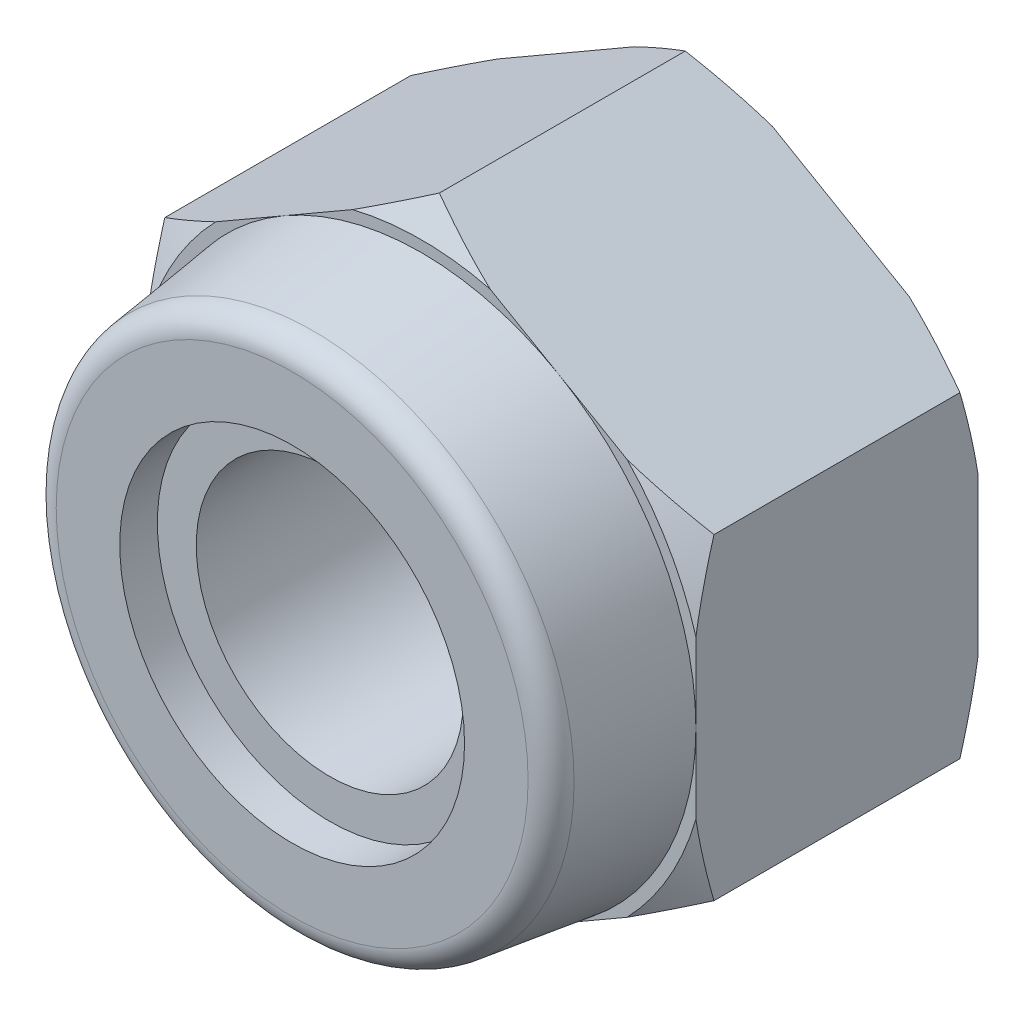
ISO-10303-21;
HEADER;
FILE_DESCRIPTION(('STEP AP214'),'2;1');
FILE_NAME('part.step','',(''),(''),'','','');
FILE_SCHEMA(('AUTOMOTIVE_DESIGN { 1 0 10303 214 1 1 1 1 }'));
ENDSEC;
DATA;
#1=APPLICATION_CONTEXT('core data for automotive mechanical design processes');
#2=APPLICATION_PROTOCOL_DEFINITION('international standard','automotive_design',2000,#1);
#3=PRODUCT_CONTEXT('',#1,'mechanical');
#4=PRODUCT('Part','Part','',(#3));
#5=PRODUCT_RELATED_PRODUCT_CATEGORY('part','',(#4));
#6=PRODUCT_DEFINITION_FORMATION('','',#4);
#7=PRODUCT_DEFINITION_CONTEXT('part definition',#1,'design');
#8=PRODUCT_DEFINITION('design','',#6,#7);
#9=PRODUCT_DEFINITION_SHAPE('','',#8);
#10=(LENGTH_UNIT() NAMED_UNIT(*) SI_UNIT(.MILLI.,.METRE.));
#11=(NAMED_UNIT(*) PLANE_ANGLE_UNIT() SI_UNIT($,.RADIAN.));
#12=(NAMED_UNIT(*) SI_UNIT($,.STERADIAN.) SOLID_ANGLE_UNIT());
#13=UNCERTAINTY_MEASURE_WITH_UNIT(LENGTH_MEASURE(1.E-05),#10,'distance_accuracy_value','');
#14=(GEOMETRIC_REPRESENTATION_CONTEXT(3) GLOBAL_UNCERTAINTY_ASSIGNED_CONTEXT((#13)) GLOBAL_UNIT_ASSIGNED_CONTEXT((#10,
#11,#12)) REPRESENTATION_CONTEXT('',''));
#15=CARTESIAN_POINT('',(0.,0.,0.));
#16=DIRECTION('',(0.,0.,1.));
#17=DIRECTION('',(1.,0.,0.));
#18=AXIS2_PLACEMENT_3D('',#15,#16,#17);
#19=CARTESIAN_POINT('',(5.5626,-3.21156860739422,0.));
#20=DIRECTION('',(0.,0.,1.));
#21=DIRECTION('',(1.,0.,0.));
#22=AXIS2_PLACEMENT_3D('',#19,#20,#21);
#23=PLANE('',#22);
#24=DIRECTION('',(0.,1.,0.));
#25=VECTOR('',#24,1.);
#26=CARTESIAN_POINT('',(5.5626,-3.21156860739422,0.));
#27=LINE('',#26,#25);
#28=CARTESIAN_POINT('',(5.5626,0.,0.));
#29=VERTEX_POINT('',#28);
#30=CARTESIAN_POINT('',(5.5626,1.60000426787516,0.));
#31=VERTEX_POINT('',#30);
#32=EDGE_CURVE('E498',#29,#31,#27,.T.);
#33=ORIENTED_EDGE('',*,*,#32,.T.);
#34=CARTESIAN_POINT('',(0.,0.,0.));
#35=DIRECTION('',(0.,0.,1.));
#36=DIRECTION('',(1.,0.,0.));
#37=AXIS2_PLACEMENT_3D('',#34,#35,#36);
#38=CIRCLE('',#37,5.78813721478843);
#39=CARTESIAN_POINT('',(4.1669443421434,4.01735077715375,0.));
#40=VERTEX_POINT('',#39);
#41=EDGE_CURVE('E193',#31,#40,#38,.T.);
#42=ORIENTED_EDGE('',*,*,#41,.T.);
#43=DIRECTION('',(-0.866025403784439,0.5,0.));
#44=VECTOR('',#43,1.);
#45=CARTESIAN_POINT('',(5.5626,3.21156860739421,0.));
#46=LINE('',#45,#44);
#47=CARTESIAN_POINT('',(2.7813,4.81735291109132,0.));
#48=VERTEX_POINT('',#47);
#49=EDGE_CURVE('E209',#40,#48,#46,.T.);
#50=ORIENTED_EDGE('',*,*,#49,.T.);
#51=CARTESIAN_POINT('',(0.,0.,0.));
#52=DIRECTION('',(0.,0.,1.));
#53=DIRECTION('',(1.,0.,0.));
#54=AXIS2_PLACEMENT_3D('',#51,#52,#53);
#55=CIRCLE('',#54,5.5626);
#56=EDGE_CURVE('E244',#29,#48,#55,.T.);
#57=ORIENTED_EDGE('',*,*,#56,.F.);
#58=EDGE_LOOP('',(#33,#42,#50,#57));
#59=FACE_BOUND('',#58,.T.);
#60=ADVANCED_FACE('F45',(#59),#23,.T.);
#61=CARTESIAN_POINT('',(1.3956556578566,5.61735504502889,0.));
#62=VERTEX_POINT('',#61);
#63=EDGE_CURVE('E502',#48,#62,#46,.T.);
#64=ORIENTED_EDGE('',*,*,#63,.T.);
#65=CARTESIAN_POINT('',(-1.3956556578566,5.6173550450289,0.));
#66=VERTEX_POINT('',#65);
#67=EDGE_CURVE('E468',#62,#66,#38,.T.);
#68=ORIENTED_EDGE('',*,*,#67,.T.);
#69=DIRECTION('',(-0.866025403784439,-0.5,0.));
#70=VECTOR('',#69,1.);
#71=CARTESIAN_POINT('',(0.,6.42313721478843,0.));
#72=LINE('',#71,#70);
#73=CARTESIAN_POINT('',(-2.7813,4.81735291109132,0.));
#74=VERTEX_POINT('',#73);
#75=EDGE_CURVE('E505',#66,#74,#72,.T.);
#76=ORIENTED_EDGE('',*,*,#75,.T.);
#77=EDGE_CURVE('E236',#48,#74,#55,.T.);
#78=ORIENTED_EDGE('',*,*,#77,.F.);
#79=EDGE_LOOP('',(#64,#68,#76,#78));
#80=FACE_BOUND('',#79,.T.);
#81=ADVANCED_FACE('F397',(#80),#23,.T.);
#82=CARTESIAN_POINT('',(-4.1669443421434,4.01735077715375,0.));
#83=VERTEX_POINT('',#82);
#84=EDGE_CURVE('E504',#74,#83,#72,.T.);
#85=ORIENTED_EDGE('',*,*,#84,.T.);
#86=CARTESIAN_POINT('',(-5.5626,1.60000426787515,0.));
#87=VERTEX_POINT('',#86);
#88=EDGE_CURVE('E470',#83,#87,#38,.T.);
#89=ORIENTED_EDGE('',*,*,#88,.T.);
#90=DIRECTION('',(0.,-1.,0.));
#91=VECTOR('',#90,1.);
#92=CARTESIAN_POINT('',(-5.5626,3.21156860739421,0.));
#93=LINE('',#92,#91);
#94=CARTESIAN_POINT('',(-5.5626,0.,0.));
#95=VERTEX_POINT('',#94);
#96=EDGE_CURVE('E298',#87,#95,#93,.T.);
#97=ORIENTED_EDGE('',*,*,#96,.T.);
#98=EDGE_CURVE('E242',#74,#95,#55,.T.);
#99=ORIENTED_EDGE('',*,*,#98,.F.);
#100=EDGE_LOOP('',(#85,#89,#97,#99));
#101=FACE_BOUND('',#100,.T.);
#102=ADVANCED_FACE('F516',(#101),#23,.T.);
#103=CARTESIAN_POINT('',(-5.5626,-1.60000426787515,0.));
#104=VERTEX_POINT('',#103);
#105=EDGE_CURVE('E506',#95,#104,#93,.T.);
#106=ORIENTED_EDGE('',*,*,#105,.T.);
#107=CARTESIAN_POINT('',(-4.16694434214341,-4.01735077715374,0.));
#108=VERTEX_POINT('',#107);
#109=EDGE_CURVE('E69',#104,#108,#38,.T.);
#110=ORIENTED_EDGE('',*,*,#109,.T.);
#111=DIRECTION('',(0.866025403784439,-0.5,0.));
#112=VECTOR('',#111,1.);
#113=CARTESIAN_POINT('',(-5.5626,-3.21156860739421,0.));
#114=LINE('',#113,#112);
#115=CARTESIAN_POINT('',(-2.7813,-4.81735291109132,0.));
#116=VERTEX_POINT('',#115);
#117=EDGE_CURVE('E275',#108,#116,#114,.T.);
#118=ORIENTED_EDGE('',*,*,#117,.T.);
#119=EDGE_CURVE('E249',#95,#116,#55,.T.);
#120=ORIENTED_EDGE('',*,*,#119,.F.);
#121=EDGE_LOOP('',(#106,#110,#118,#120));
#122=FACE_BOUND('',#121,.T.);
#123=ADVANCED_FACE('F513',(#122),#23,.T.);
#124=CARTESIAN_POINT('',(-1.3956556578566,-5.61735504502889,0.));
#125=VERTEX_POINT('',#124);
#126=EDGE_CURVE('E507',#116,#125,#114,.T.);
#127=ORIENTED_EDGE('',*,*,#126,.T.);
#128=CARTESIAN_POINT('',(1.39565565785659,-5.6173550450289,0.));
#129=VERTEX_POINT('',#128);
#130=EDGE_CURVE('E61',#125,#129,#38,.T.);
#131=ORIENTED_EDGE('',*,*,#130,.T.);
#132=DIRECTION('',(0.866025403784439,0.5,0.));
#133=VECTOR('',#132,1.);
#134=CARTESIAN_POINT('',(0.,-6.42313721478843,0.));
#135=LINE('',#134,#133);
#136=CARTESIAN_POINT('',(2.7813,-4.81735291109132,0.));
#137=VERTEX_POINT('',#136);
#138=EDGE_CURVE('E496',#129,#137,#135,.T.);
#139=ORIENTED_EDGE('',*,*,#138,.T.);
#140=EDGE_CURVE('E262',#116,#137,#55,.T.);
#141=ORIENTED_EDGE('',*,*,#140,.F.);
#142=EDGE_LOOP('',(#127,#131,#139,#141));
#143=FACE_BOUND('',#142,.T.);
#144=ADVANCED_FACE('F619',(#143),#23,.T.);
#145=CARTESIAN_POINT('',(0.,-6.42313721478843,-5.715));
#146=DIRECTION('',(0.5,-0.866025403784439,0.));
#147=DIRECTION('',(0.866025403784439,0.5,0.));
#148=AXIS2_PLACEMENT_3D('',#145,#146,#147);
#149=PLANE('',#148);
#150=DIRECTION('',(0.,0.,1.));
#151=VECTOR('',#150,1.);
#152=CARTESIAN_POINT('',(5.5626,-3.21156860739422,-5.715));
#153=LINE('',#152,#151);
#154=CARTESIAN_POINT('',(5.5626,-3.21156860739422,-5.34838257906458));
#155=VERTEX_POINT('',#154);
#156=CARTESIAN_POINT('',(5.5626,-3.21156860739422,-0.366617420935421));
#157=VERTEX_POINT('',#156);
#158=EDGE_CURVE('E217',#155,#157,#153,.T.);
#159=ORIENTED_EDGE('',*,*,#158,.T.);
#160=CARTESIAN_POINT('',(9.42295491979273,-0.982791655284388,-2.12807296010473));
#161=CARTESIAN_POINT('',(9.2481954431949,-1.08368908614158,-2.03378314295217));
#162=CARTESIAN_POINT('',(9.07301757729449,-1.18482807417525,-1.94051140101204));
#163=CARTESIAN_POINT('',(8.72164863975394,-1.38769102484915,-1.75648219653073));
#164=CARTESIAN_POINT('',(8.54545744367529,-1.48941505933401,-1.66572505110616));
#165=CARTESIAN_POINT('',(8.19136127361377,-1.69385257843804,-1.48694033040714));
#166=CARTESIAN_POINT('',(8.01345261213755,-1.7965681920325,-1.39892246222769));
#167=CARTESIAN_POINT('',(7.65630184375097,-2.00276928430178,-1.22657910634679));
#168=CARTESIAN_POINT('',(7.47705977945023,-2.10625473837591,-1.14225350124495));
#169=CARTESIAN_POINT('',(7.11245871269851,-2.31675726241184,-0.976019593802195));
#170=CARTESIAN_POINT('',(6.92705994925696,-2.42379728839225,-0.894227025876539));
#171=CARTESIAN_POINT('',(6.55439179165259,-2.63895734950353,-0.736473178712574));
#172=CARTESIAN_POINT('',(6.36712230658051,-2.7470774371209,-0.66051218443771));
#173=CARTESIAN_POINT('',(5.99066950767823,-2.96442256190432,-0.515868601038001));
#174=CARTESIAN_POINT('',(5.80148823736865,-3.07364641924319,-0.447178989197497));
#175=CARTESIAN_POINT('',(5.42090459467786,-3.29337648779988,-0.318664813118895));
#176=CARTESIAN_POINT('',(5.22950251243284,-3.4038825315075,-0.258839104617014));
#177=CARTESIAN_POINT('',(4.7717339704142,-3.6681753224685,-0.129442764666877));
#178=CARTESIAN_POINT('',(4.50430080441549,-3.8225779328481,-0.064696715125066));
#179=CARTESIAN_POINT('',(4.10041076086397,-4.05576395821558,0.0130990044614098));
#180=CARTESIAN_POINT('',(3.96532631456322,-4.13375499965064,0.0358101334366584));
#181=CARTESIAN_POINT('',(3.69441769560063,-4.29016416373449,0.0742198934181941));
#182=CARTESIAN_POINT('',(3.55859362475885,-4.36858222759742,0.0899194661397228));
#183=CARTESIAN_POINT('',(3.28802057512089,-4.52479765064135,0.113719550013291));
#184=CARTESIAN_POINT('',(3.15327727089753,-4.60259173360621,0.121905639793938));
#185=CARTESIAN_POINT('',(2.88360480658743,-4.75828720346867,0.130744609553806));
#186=CARTESIAN_POINT('',(2.74867564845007,-4.83618858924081,0.131397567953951));
#187=CARTESIAN_POINT('',(2.47894976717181,-4.99191489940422,0.12514947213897));
#188=CARTESIAN_POINT('',(2.34415304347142,-5.06973982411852,0.118248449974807));
#189=CARTESIAN_POINT('',(2.07497866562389,-5.22514772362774,0.0971012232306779));
#190=CARTESIAN_POINT('',(1.94060107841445,-5.30273065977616,0.0828539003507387));
#191=CARTESIAN_POINT('',(1.62309471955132,-5.48604304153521,0.0408724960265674));
#192=CARTESIAN_POINT('',(1.44026472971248,-5.5915999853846,0.0101022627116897));
#193=CARTESIAN_POINT('',(1.07635581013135,-5.80170289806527,-0.0630230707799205));
#194=CARTESIAN_POINT('',(0.895277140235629,-5.90624871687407,-0.105379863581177));
#195=CARTESIAN_POINT('',(0.534892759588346,-6.11431673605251,-0.200079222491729));
#196=CARTESIAN_POINT('',(0.35558929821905,-6.21783763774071,-0.252433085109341));
#197=CARTESIAN_POINT('',(-0.00100447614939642,-6.42371714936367,-0.365477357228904));
#198=CARTESIAN_POINT('',(-0.1782949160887,-6.52607583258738,-0.426167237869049));
#199=CARTESIAN_POINT('',(-0.533083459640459,-6.73091309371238,-0.555205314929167));
#200=CARTESIAN_POINT('',(-0.710558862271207,-6.83337856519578,-0.623636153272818));
#201=CARTESIAN_POINT('',(-1.06362951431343,-7.03722400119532,-0.766239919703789));
#202=CARTESIAN_POINT('',(-1.23922592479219,-7.13860463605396,-0.84040903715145));
#203=CARTESIAN_POINT('',(-1.5888184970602,-7.34044200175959,-0.993471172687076));
#204=CARTESIAN_POINT('',(-1.76281498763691,-7.4408989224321,-1.07236319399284));
#205=CARTESIAN_POINT('',(-2.10944403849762,-7.64102529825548,-1.23404436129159));
#206=CARTESIAN_POINT('',(-2.28207657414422,-7.74069473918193,-1.31683357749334));
#207=CARTESIAN_POINT('',(-2.57291488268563,-7.90861031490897,-1.45951571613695));
#208=CARTESIAN_POINT('',(-2.69143196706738,-7.97703618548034,-1.51856612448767));
#209=CARTESIAN_POINT('',(-2.92794924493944,-8.11358949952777,-1.63801912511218));
#210=CARTESIAN_POINT('',(-3.04594945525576,-8.18171695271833,-1.69842167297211));
#211=CARTESIAN_POINT('',(-3.28024937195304,-8.31699007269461,-1.81977975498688));
#212=CARTESIAN_POINT('',(-3.39655392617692,-8.38413853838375,-1.88072282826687));
#213=CARTESIAN_POINT('',(-3.62875242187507,-8.5181984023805,-2.00364973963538));
#214=CARTESIAN_POINT('',(-3.74464635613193,-8.58510979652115,-2.06563359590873));
#215=CARTESIAN_POINT('',(-3.86035491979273,-8.65191416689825,-2.12807296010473));
#216=B_SPLINE_CURVE_WITH_KNOTS('',3,(#160,#161,#162,#163,#164,#165,#166,#167,#168,#169,#170,
#171,#172,#173,#174,#175,#176,#177,#178,#179,#180,#181,#182,#183,#184,#185,#186,#187,#188,#189,
#190,#191,#192,#193,#194,#195,#196,#197,#198,#199,#200,#201,#202,#203,#204,#205,#206,#207,#208,
#209,#210,#211,#212,#213,#214,#215),.UNSPECIFIED.,.F.,.F.,(4,2,2,2,2,2,2,2,2,2,2,2,2,2,2,2,2,2,
2,2,2,2,2,2,2,2,2,4),(0.,0.668217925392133,1.33651973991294,2.00696882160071,2.67739656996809,
3.36484632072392,4.05232964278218,4.73914281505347,5.42586724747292,6.37139841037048,
6.8441481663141,7.31683440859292,7.78406740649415,8.25129554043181,8.71852169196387,
9.18581898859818,9.82546536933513,10.4652052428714,11.1056723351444,11.7460988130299,
12.3941569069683,13.0417882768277,13.6892834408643,14.3367902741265,14.7839276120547,
15.2310502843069,15.6734793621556,16.1159161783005),.UNSPECIFIED.);
#217=CARTESIAN_POINT('',(4.1669443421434,-4.01735077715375,0.));
#218=VERTEX_POINT('',#217);
#219=EDGE_CURVE('E198',#157,#218,#216,.T.);
#220=ORIENTED_EDGE('',*,*,#219,.T.);
#221=EDGE_CURVE('E499',#137,#218,#135,.T.);
#222=ORIENTED_EDGE('',*,*,#221,.F.);
#223=ORIENTED_EDGE('',*,*,#138,.F.);
#224=CARTESIAN_POINT('',(0.,-6.42313721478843,-0.366617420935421));
#225=VERTEX_POINT('',#224);
#226=EDGE_CURVE('E454',#129,#225,#216,.T.);
#227=ORIENTED_EDGE('',*,*,#226,.T.);
#228=DIRECTION('',(0.,0.,1.));
#229=VECTOR('',#228,1.);
#230=CARTESIAN_POINT('',(0.,-6.42313721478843,-5.715));
#231=LINE('',#230,#229);
#232=CARTESIAN_POINT('',(0.,-6.42313721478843,-5.34838257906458));
#233=VERTEX_POINT('',#232);
#234=EDGE_CURVE('E263',#233,#225,#231,.T.);
#235=ORIENTED_EDGE('',*,*,#234,.F.);
#236=CARTESIAN_POINT('',(9.42295491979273,-0.982791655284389,-3.58692703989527));
#237=CARTESIAN_POINT('',(9.2481954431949,-1.08368908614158,-3.68121685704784));
#238=CARTESIAN_POINT('',(9.07301757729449,-1.18482807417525,-3.77448859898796));
#239=CARTESIAN_POINT('',(8.72164863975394,-1.38769102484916,-3.95851780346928));
#240=CARTESIAN_POINT('',(8.54545744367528,-1.48941505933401,-4.04927494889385));
#241=CARTESIAN_POINT('',(8.19136127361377,-1.69385257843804,-4.22805966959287));
#242=CARTESIAN_POINT('',(8.01345261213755,-1.79656819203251,-4.31607753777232));
#243=CARTESIAN_POINT('',(7.65630184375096,-2.00276928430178,-4.48842089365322));
#244=CARTESIAN_POINT('',(7.47705977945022,-2.10625473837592,-4.57274649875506));
#245=CARTESIAN_POINT('',(7.1124587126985,-2.31675726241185,-4.73898040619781));
#246=CARTESIAN_POINT('',(6.92705994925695,-2.42379728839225,-4.82077297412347));
#247=CARTESIAN_POINT('',(6.55439179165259,-2.63895734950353,-4.97852682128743));
#248=CARTESIAN_POINT('',(6.3671223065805,-2.74707743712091,-5.0544878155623));
#249=CARTESIAN_POINT('',(5.99066950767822,-2.96442256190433,-5.199131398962));
#250=CARTESIAN_POINT('',(5.80148823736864,-3.0736464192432,-5.26782101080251));
#251=CARTESIAN_POINT('',(5.42090459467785,-3.29337648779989,-5.39633518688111));
#252=CARTESIAN_POINT('',(5.22950251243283,-3.40388253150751,-5.45616089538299));
#253=CARTESIAN_POINT('',(4.77173397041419,-3.66817532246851,-5.58555723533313));
#254=CARTESIAN_POINT('',(4.50430080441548,-3.8225779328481,-5.65030328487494));
#255=CARTESIAN_POINT('',(4.10041076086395,-4.05576395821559,-5.72809900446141));
#256=CARTESIAN_POINT('',(3.96532631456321,-4.13375499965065,-5.75081013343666));
#257=CARTESIAN_POINT('',(3.69441769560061,-4.2901641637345,-5.7892198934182));
#258=CARTESIAN_POINT('',(3.55859362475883,-4.36858222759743,-5.80491946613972));
#259=CARTESIAN_POINT('',(3.28802057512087,-4.52479765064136,-5.82871955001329));
#260=CARTESIAN_POINT('',(3.15327727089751,-4.60259173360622,-5.83690563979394));
#261=CARTESIAN_POINT('',(2.88360480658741,-4.75828720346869,-5.84574460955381));
#262=CARTESIAN_POINT('',(2.74867564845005,-4.83618858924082,-5.84639756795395));
#263=CARTESIAN_POINT('',(2.47894976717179,-4.99191489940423,-5.84014947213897));
#264=CARTESIAN_POINT('',(2.3441530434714,-5.06973982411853,-5.8332484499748));
#265=CARTESIAN_POINT('',(2.07497866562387,-5.22514772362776,-5.81210122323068));
#266=CARTESIAN_POINT('',(1.94060107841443,-5.30273065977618,-5.79785390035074));
#267=CARTESIAN_POINT('',(1.62309471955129,-5.48604304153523,-5.75587249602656));
#268=CARTESIAN_POINT('',(1.44026472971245,-5.59159998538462,-5.72510226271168));
#269=CARTESIAN_POINT('',(1.07635581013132,-5.80170289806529,-5.65197692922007));
#270=CARTESIAN_POINT('',(0.895277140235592,-5.90624871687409,-5.60962013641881));
#271=CARTESIAN_POINT('',(0.534892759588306,-6.11431673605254,-5.51492077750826));
#272=CARTESIAN_POINT('',(0.355589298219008,-6.21783763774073,-5.46256691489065));
#273=CARTESIAN_POINT('',(-0.00100447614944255,-6.4237171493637,-5.34952264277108));
#274=CARTESIAN_POINT('',(-0.178294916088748,-6.5260758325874,-5.28883276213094));
#275=CARTESIAN_POINT('',(-0.533083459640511,-6.73091309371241,-5.15979468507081));
#276=CARTESIAN_POINT('',(-0.710558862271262,-6.83337856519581,-5.09136384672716));
#277=CARTESIAN_POINT('',(-1.06362951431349,-7.03722400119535,-4.94876008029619));
#278=CARTESIAN_POINT('',(-1.23922592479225,-7.13860463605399,-4.87459096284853));
#279=CARTESIAN_POINT('',(-1.58881849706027,-7.34044200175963,-4.7215288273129));
#280=CARTESIAN_POINT('',(-1.76281498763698,-7.44089892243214,-4.64263680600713));
#281=CARTESIAN_POINT('',(-2.10944403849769,-7.64102529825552,-4.48095563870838));
#282=CARTESIAN_POINT('',(-2.28207657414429,-7.74069473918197,-4.39816642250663));
#283=CARTESIAN_POINT('',(-2.57291488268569,-7.908610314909,-4.25548428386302));
#284=CARTESIAN_POINT('',(-2.69143196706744,-7.97703618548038,-4.1964338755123));
#285=CARTESIAN_POINT('',(-2.92794924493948,-8.11358949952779,-4.0769808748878));
#286=CARTESIAN_POINT('',(-3.0459494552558,-8.18171695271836,-4.01657832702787));
#287=CARTESIAN_POINT('',(-3.28024937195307,-8.31699007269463,-3.89522024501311));
#288=CARTESIAN_POINT('',(-3.39655392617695,-8.38413853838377,-3.83427717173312));
#289=CARTESIAN_POINT('',(-3.62875242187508,-8.51819840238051,-3.71135026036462));
#290=CARTESIAN_POINT('',(-3.74464635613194,-8.58510979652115,-3.64936640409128));
#291=CARTESIAN_POINT('',(-3.86035491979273,-8.65191416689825,-3.58692703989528));
#292=B_SPLINE_CURVE_WITH_KNOTS('',3,(#236,#237,#238,#239,#240,#241,#242,#243,#244,#245,#246,
#247,#248,#249,#250,#251,#252,#253,#254,#255,#256,#257,#258,#259,#260,#261,#262,#263,#264,#265,
#266,#267,#268,#269,#270,#271,#272,#273,#274,#275,#276,#277,#278,#279,#280,#281,#282,#283,#284,
#285,#286,#287,#288,#289,#290,#291),.UNSPECIFIED.,.F.,.F.,(4,2,2,2,2,2,2,2,2,2,2,2,2,2,2,2,2,2,
2,2,2,2,2,2,2,2,2,4),(0.,0.668217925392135,1.33651973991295,2.00696882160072,2.6773965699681,
3.36484632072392,4.05232964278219,4.73914281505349,5.42586724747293,6.37139841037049,
6.84414816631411,7.31683440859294,7.78406740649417,8.25129554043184,8.71852169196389,
9.18581898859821,9.82546536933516,10.4652052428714,11.1056723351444,11.74609881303,
12.3941569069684,13.0417882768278,13.6892834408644,14.3367902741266,14.7839276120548,
15.231050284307,15.6734793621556,16.1159161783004),.UNSPECIFIED.);
#293=CARTESIAN_POINT('',(1.3956556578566,-5.6173550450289,-5.715));
#294=VERTEX_POINT('',#293);
#295=EDGE_CURVE('E253',#294,#233,#292,.T.);
#296=ORIENTED_EDGE('',*,*,#295,.F.);
#297=DIRECTION('',(0.866025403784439,0.5,0.));
#298=VECTOR('',#297,1.);
#299=CARTESIAN_POINT('',(0.,-6.42313721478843,-5.715));
#300=LINE('',#299,#298);
#301=CARTESIAN_POINT('',(4.1669443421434,-4.01735077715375,-5.715));
#302=VERTEX_POINT('',#301);
#303=EDGE_CURVE('E484',#294,#302,#300,.T.);
#304=ORIENTED_EDGE('',*,*,#303,.T.);
#305=EDGE_CURVE('E261',#155,#302,#292,.T.);
#306=ORIENTED_EDGE('',*,*,#305,.F.);
#307=EDGE_LOOP('',(#159,#220,#222,#223,#227,#235,#296,#304,#306));
#308=FACE_BOUND('',#307,.T.);
#309=ADVANCED_FACE('F47',(#308),#149,.T.);
#310=CARTESIAN_POINT('',(-5.5626,-3.21156860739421,-5.715));
#311=DIRECTION('',(-0.5,-0.866025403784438,0.));
#312=DIRECTION('',(0.866025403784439,-0.5,0.));
#313=AXIS2_PLACEMENT_3D('',#310,#311,#312);
#314=PLANE('',#313);
#315=ORIENTED_EDGE('',*,*,#234,.T.);
#316=CARTESIAN_POINT('',(3.86035491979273,-8.65191416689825,-2.12807296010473));
#317=CARTESIAN_POINT('',(3.6855954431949,-8.55101673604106,-2.03378314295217));
#318=CARTESIAN_POINT('',(3.51041757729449,-8.4498777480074,-1.94051140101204));
#319=CARTESIAN_POINT('',(3.15904863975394,-8.24701479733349,-1.75648219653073));
#320=CARTESIAN_POINT('',(2.98285744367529,-8.14529076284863,-1.66572505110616));
#321=CARTESIAN_POINT('',(2.62876127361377,-7.9408532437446,-1.48694033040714));
#322=CARTESIAN_POINT('',(2.45085261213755,-7.83813763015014,-1.39892246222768));
#323=CARTESIAN_POINT('',(2.09370184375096,-7.63193653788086,-1.22657910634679));
#324=CARTESIAN_POINT('',(1.91445977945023,-7.52845108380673,-1.14225350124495));
#325=CARTESIAN_POINT('',(1.54985871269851,-7.3179485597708,-0.976019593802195));
#326=CARTESIAN_POINT('',(1.36445994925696,-7.21090853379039,-0.89422702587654));
#327=CARTESIAN_POINT('',(0.991791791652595,-6.99574847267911,-0.736473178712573));
#328=CARTESIAN_POINT('',(0.804522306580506,-6.88762838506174,-0.660512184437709));
#329=CARTESIAN_POINT('',(0.428069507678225,-6.67028326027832,-0.515868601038));
#330=CARTESIAN_POINT('',(0.238888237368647,-6.56105940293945,-0.447178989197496));
#331=CARTESIAN_POINT('',(-0.141695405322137,-6.34132933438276,-0.318664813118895));
#332=CARTESIAN_POINT('',(-0.333097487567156,-6.23082329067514,-0.258839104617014));
#333=CARTESIAN_POINT('',(-0.790866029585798,-5.96653049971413,-0.129442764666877));
#334=CARTESIAN_POINT('',(-1.05829919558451,-5.81212788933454,-0.0646967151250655));
#335=CARTESIAN_POINT('',(-1.46218923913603,-5.57894186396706,0.0130990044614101));
#336=CARTESIAN_POINT('',(-1.59727368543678,-5.500950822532,0.0358101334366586));
#337=CARTESIAN_POINT('',(-1.86818230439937,-5.34454165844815,0.0742198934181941));
#338=CARTESIAN_POINT('',(-2.00400637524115,-5.26612359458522,0.0899194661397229));
#339=CARTESIAN_POINT('',(-2.2745794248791,-5.10990817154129,0.113719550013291));
#340=CARTESIAN_POINT('',(-2.40932272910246,-5.03211408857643,0.121905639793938));
#341=CARTESIAN_POINT('',(-2.67899519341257,-4.87641861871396,0.130744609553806));
#342=CARTESIAN_POINT('',(-2.81392435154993,-4.79851723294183,0.131397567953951));
#343=CARTESIAN_POINT('',(-3.08365023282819,-4.64279092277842,0.125149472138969));
#344=CARTESIAN_POINT('',(-3.21844695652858,-4.56496599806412,0.118248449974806));
#345=CARTESIAN_POINT('',(-3.48762133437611,-4.4095580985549,0.0971012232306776));
#346=CARTESIAN_POINT('',(-3.62199892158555,-4.33197516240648,0.0828539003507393));
#347=CARTESIAN_POINT('',(-3.93950528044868,-4.14866278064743,0.0408724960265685));
#348=CARTESIAN_POINT('',(-4.12233527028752,-4.04310583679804,0.0101022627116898));
#349=CARTESIAN_POINT('',(-4.48624418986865,-3.83300292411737,-0.0630230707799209));
#350=CARTESIAN_POINT('',(-4.66732285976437,-3.72845710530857,-0.105379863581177));
#351=CARTESIAN_POINT('',(-5.02770724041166,-3.52038908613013,-0.200079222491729));
#352=CARTESIAN_POINT('',(-5.20701070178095,-3.41686818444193,-0.252433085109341));
#353=CARTESIAN_POINT('',(-5.5636044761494,-3.21098867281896,-0.365477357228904));
#354=CARTESIAN_POINT('',(-5.7408949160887,-3.10862998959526,-0.426167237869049));
#355=CARTESIAN_POINT('',(-6.09568345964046,-2.90379272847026,-0.555205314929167));
#356=CARTESIAN_POINT('',(-6.27315886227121,-2.80132725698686,-0.623636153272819));
#357=CARTESIAN_POINT('',(-6.62622951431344,-2.59748182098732,-0.76623991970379));
#358=CARTESIAN_POINT('',(-6.80182592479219,-2.49610118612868,-0.840409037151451));
#359=CARTESIAN_POINT('',(-7.15141849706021,-2.29426382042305,-0.993471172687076));
#360=CARTESIAN_POINT('',(-7.32541498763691,-2.19380689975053,-1.07236319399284));
#361=CARTESIAN_POINT('',(-7.67204403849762,-1.99368052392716,-1.23404436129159));
#362=CARTESIAN_POINT('',(-7.84467657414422,-1.89401108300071,-1.31683357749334));
#363=CARTESIAN_POINT('',(-8.13551488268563,-1.72609550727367,-1.45951571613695));
#364=CARTESIAN_POINT('',(-8.25403196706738,-1.6576696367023,-1.51856612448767));
#365=CARTESIAN_POINT('',(-8.49054924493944,-1.52111632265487,-1.63801912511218));
#366=CARTESIAN_POINT('',(-8.60854945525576,-1.4529888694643,-1.69842167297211));
#367=CARTESIAN_POINT('',(-8.84284937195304,-1.31771574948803,-1.81977975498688));
#368=CARTESIAN_POINT('',(-8.95915392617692,-1.25056728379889,-1.88072282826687));
#369=CARTESIAN_POINT('',(-9.19135242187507,-1.11650741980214,-2.00364973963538));
#370=CARTESIAN_POINT('',(-9.30724635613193,-1.04959602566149,-2.06563359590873));
#371=CARTESIAN_POINT('',(-9.42295491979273,-0.982791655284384,-2.12807296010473));
#372=B_SPLINE_CURVE_WITH_KNOTS('',3,(#316,#317,#318,#319,#320,#321,#322,#323,#324,#325,#326,
#327,#328,#329,#330,#331,#332,#333,#334,#335,#336,#337,#338,#339,#340,#341,#342,#343,#344,#345,
#346,#347,#348,#349,#350,#351,#352,#353,#354,#355,#356,#357,#358,#359,#360,#361,#362,#363,#364,
#365,#366,#367,#368,#369,#370,#371),.UNSPECIFIED.,.F.,.F.,(4,2,2,2,2,2,2,2,2,2,2,2,2,2,2,2,2,2,
2,2,2,2,2,2,2,2,2,4),(0.,0.668217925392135,1.33651973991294,2.00696882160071,2.67739656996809,
3.36484632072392,4.05232964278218,4.73914281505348,5.42586724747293,6.37139841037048,
6.8441481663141,7.31683440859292,7.78406740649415,8.25129554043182,8.71852169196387,
9.18581898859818,9.82546536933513,10.4652052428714,11.1056723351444,11.7460988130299,
12.3941569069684,13.0417882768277,13.6892834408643,14.3367902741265,14.7839276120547,
15.2310502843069,15.6734793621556,16.1159161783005),.UNSPECIFIED.);
#373=EDGE_CURVE('E461',#225,#125,#372,.T.);
#374=ORIENTED_EDGE('',*,*,#373,.T.);
#375=ORIENTED_EDGE('',*,*,#126,.F.);
#376=ORIENTED_EDGE('',*,*,#117,.F.);
#377=CARTESIAN_POINT('',(-5.5626,-3.21156860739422,-0.366617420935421));
#378=VERTEX_POINT('',#377);
#379=EDGE_CURVE('E303',#108,#378,#372,.T.);
#380=ORIENTED_EDGE('',*,*,#379,.T.);
#381=DIRECTION('',(0.,0.,1.));
#382=VECTOR('',#381,1.);
#383=CARTESIAN_POINT('',(-5.5626,-3.21156860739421,-5.715));
#384=LINE('',#383,#382);
#385=CARTESIAN_POINT('',(-5.5626,-3.21156860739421,-5.34838257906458));
#386=VERTEX_POINT('',#385);
#387=EDGE_CURVE('E267',#386,#378,#384,.T.);
#388=ORIENTED_EDGE('',*,*,#387,.F.);
#389=CARTESIAN_POINT('',(3.86035491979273,-8.65191416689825,-3.58692703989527));
#390=CARTESIAN_POINT('',(3.6855954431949,-8.55101673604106,-3.68121685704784));
#391=CARTESIAN_POINT('',(3.51041757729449,-8.44987774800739,-3.77448859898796));
#392=CARTESIAN_POINT('',(3.15904863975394,-8.24701479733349,-3.95851780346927));
#393=CARTESIAN_POINT('',(2.98285744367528,-8.14529076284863,-4.04927494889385));
#394=CARTESIAN_POINT('',(2.62876127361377,-7.9408532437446,-4.22805966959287));
#395=CARTESIAN_POINT('',(2.45085261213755,-7.83813763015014,-4.31607753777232));
#396=CARTESIAN_POINT('',(2.09370184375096,-7.63193653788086,-4.48842089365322));
#397=CARTESIAN_POINT('',(1.91445977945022,-7.52845108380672,-4.57274649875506));
#398=CARTESIAN_POINT('',(1.54985871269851,-7.3179485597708,-4.73898040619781));
#399=CARTESIAN_POINT('',(1.36445994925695,-7.21090853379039,-4.82077297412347));
#400=CARTESIAN_POINT('',(0.991791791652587,-6.99574847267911,-4.97852682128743));
#401=CARTESIAN_POINT('',(0.804522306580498,-6.88762838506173,-5.0544878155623));
#402=CARTESIAN_POINT('',(0.428069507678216,-6.67028326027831,-5.199131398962));
#403=CARTESIAN_POINT('',(0.238888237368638,-6.56105940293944,-5.26782101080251));
#404=CARTESIAN_POINT('',(-0.141695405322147,-6.34132933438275,-5.39633518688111));
#405=CARTESIAN_POINT('',(-0.333097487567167,-6.23082329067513,-5.45616089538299));
#406=CARTESIAN_POINT('',(-0.790866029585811,-5.96653049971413,-5.58555723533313));
#407=CARTESIAN_POINT('',(-1.05829919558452,-5.81212788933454,-5.65030328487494));
#408=CARTESIAN_POINT('',(-1.46218923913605,-5.57894186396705,-5.72809900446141));
#409=CARTESIAN_POINT('',(-1.59727368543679,-5.50095082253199,-5.75081013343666));
#410=CARTESIAN_POINT('',(-1.86818230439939,-5.34454165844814,-5.7892198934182));
#411=CARTESIAN_POINT('',(-2.00400637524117,-5.26612359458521,-5.80491946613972));
#412=CARTESIAN_POINT('',(-2.27457942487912,-5.10990817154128,-5.82871955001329));
#413=CARTESIAN_POINT('',(-2.40932272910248,-5.03211408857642,-5.83690563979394));
#414=CARTESIAN_POINT('',(-2.67899519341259,-4.87641861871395,-5.8457446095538));
#415=CARTESIAN_POINT('',(-2.81392435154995,-4.79851723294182,-5.84639756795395));
#416=CARTESIAN_POINT('',(-3.08365023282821,-4.64279092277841,-5.84014947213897));
#417=CARTESIAN_POINT('',(-3.2184469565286,-4.56496599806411,-5.8332484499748));
#418=CARTESIAN_POINT('',(-3.48762133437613,-4.40955809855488,-5.81210122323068));
#419=CARTESIAN_POINT('',(-3.62199892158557,-4.33197516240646,-5.79785390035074));
#420=CARTESIAN_POINT('',(-3.93950528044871,-4.14866278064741,-5.75587249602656));
#421=CARTESIAN_POINT('',(-4.12233527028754,-4.04310583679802,-5.72510226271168));
#422=CARTESIAN_POINT('',(-4.48624418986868,-3.83300292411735,-5.65197692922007));
#423=CARTESIAN_POINT('',(-4.6673228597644,-3.72845710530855,-5.60962013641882));
#424=CARTESIAN_POINT('',(-5.02770724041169,-3.52038908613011,-5.51492077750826));
#425=CARTESIAN_POINT('',(-5.20701070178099,-3.41686818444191,-5.46256691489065));
#426=CARTESIAN_POINT('',(-5.56360447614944,-3.21098867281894,-5.34952264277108));
#427=CARTESIAN_POINT('',(-5.74089491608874,-3.10862998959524,-5.28883276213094));
#428=CARTESIAN_POINT('',(-6.09568345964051,-2.90379272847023,-5.15979468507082));
#429=CARTESIAN_POINT('',(-6.27315886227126,-2.80132725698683,-5.09136384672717));
#430=CARTESIAN_POINT('',(-6.62622951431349,-2.59748182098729,-4.94876008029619));
#431=CARTESIAN_POINT('',(-6.80182592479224,-2.49610118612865,-4.87459096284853));
#432=CARTESIAN_POINT('',(-7.15141849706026,-2.29426382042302,-4.7215288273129));
#433=CARTESIAN_POINT('',(-7.32541498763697,-2.1938068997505,-4.64263680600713));
#434=CARTESIAN_POINT('',(-7.67204403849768,-1.99368052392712,-4.48095563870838));
#435=CARTESIAN_POINT('',(-7.84467657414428,-1.89401108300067,-4.39816642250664));
#436=CARTESIAN_POINT('',(-8.13551488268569,-1.72609550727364,-4.25548428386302));
#437=CARTESIAN_POINT('',(-8.25403196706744,-1.65766963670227,-4.19643387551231));
#438=CARTESIAN_POINT('',(-8.49054924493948,-1.52111632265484,-4.0769808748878));
#439=CARTESIAN_POINT('',(-8.6085494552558,-1.45298886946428,-4.01657832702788));
#440=CARTESIAN_POINT('',(-8.84284937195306,-1.31771574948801,-3.89522024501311));
#441=CARTESIAN_POINT('',(-8.95915392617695,-1.25056728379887,-3.83427717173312));
#442=CARTESIAN_POINT('',(-9.19135242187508,-1.11650741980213,-3.71135026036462));
#443=CARTESIAN_POINT('',(-9.30724635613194,-1.04959602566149,-3.64936640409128));
#444=CARTESIAN_POINT('',(-9.42295491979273,-0.982791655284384,-3.58692703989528));
#445=B_SPLINE_CURVE_WITH_KNOTS('',3,(#389,#390,#391,#392,#393,#394,#395,#396,#397,#398,#399,
#400,#401,#402,#403,#404,#405,#406,#407,#408,#409,#410,#411,#412,#413,#414,#415,#416,#417,#418,
#419,#420,#421,#422,#423,#424,#425,#426,#427,#428,#429,#430,#431,#432,#433,#434,#435,#436,#437,
#438,#439,#440,#441,#442,#443,#444),.UNSPECIFIED.,.F.,.F.,(4,2,2,2,2,2,2,2,2,2,2,2,2,2,2,2,2,2,
2,2,2,2,2,2,2,2,2,4),(0.,0.668217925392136,1.33651973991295,2.00696882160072,2.67739656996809,
3.36484632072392,4.05232964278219,4.73914281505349,5.42586724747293,6.37139841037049,
6.84414816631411,7.31683440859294,7.78406740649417,8.25129554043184,8.71852169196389,
9.18581898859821,9.82546536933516,10.4652052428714,11.1056723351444,11.7460988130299,
12.3941569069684,13.0417882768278,13.6892834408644,14.3367902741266,14.7839276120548,
15.231050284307,15.6734793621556,16.1159161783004),.UNSPECIFIED.);
#446=CARTESIAN_POINT('',(-4.1669443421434,-4.01735077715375,-5.715));
#447=VERTEX_POINT('',#446);
#448=EDGE_CURVE('E385',#447,#386,#445,.T.);
#449=ORIENTED_EDGE('',*,*,#448,.F.);
#450=DIRECTION('',(0.866025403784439,-0.5,0.));
#451=VECTOR('',#450,1.);
#452=CARTESIAN_POINT('',(-5.5626,-3.21156860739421,-5.715));
#453=LINE('',#452,#451);
#454=CARTESIAN_POINT('',(-1.39565565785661,-5.61735504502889,-5.715));
#455=VERTEX_POINT('',#454);
#456=EDGE_CURVE('E222',#447,#455,#453,.T.);
#457=ORIENTED_EDGE('',*,*,#456,.T.);
#458=EDGE_CURVE('E259',#233,#455,#445,.T.);
#459=ORIENTED_EDGE('',*,*,#458,.F.);
#460=EDGE_LOOP('',(#315,#374,#375,#376,#380,#388,#449,#457,#459));
#461=FACE_BOUND('',#460,.T.);
#462=ADVANCED_FACE('F390',(#461),#314,.T.);
#463=CARTESIAN_POINT('',(-5.5626,3.21156860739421,-5.715));
#464=DIRECTION('',(-1.,0.,0.));
#465=DIRECTION('',(0.,0.,1.));
#466=AXIS2_PLACEMENT_3D('',#463,#464,#465);
#467=PLANE('',#466);
#468=ORIENTED_EDGE('',*,*,#387,.T.);
#469=CARTESIAN_POINT('',(-5.5626,-7.07192352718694,-1.85291411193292));
#470=CARTESIAN_POINT('',(-5.5626,-6.87097025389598,-1.76174762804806));
#471=CARTESIAN_POINT('',(-5.5626,-6.66946705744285,-1.67177020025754));
#472=CARTESIAN_POINT('',(-5.5626,-6.26512525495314,-1.49477044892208));
#473=CARTESIAN_POINT('',(-5.5626,-6.06228641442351,-1.40774866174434));
#474=CARTESIAN_POINT('',(-5.5626,-5.65425901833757,-1.23691416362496));
#475=CARTESIAN_POINT('',(-5.5626,-5.44906418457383,-1.15311638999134));
#476=CARTESIAN_POINT('',(-5.5626,-5.03693928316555,-0.98991356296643));
#477=CARTESIAN_POINT('',(-5.5626,-4.83000929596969,-0.91050830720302));
#478=CARTESIAN_POINT('',(-5.5626,-4.41509364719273,-0.757413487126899));
#479=CARTESIAN_POINT('',(-5.5626,-4.20711692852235,-0.683699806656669));
#480=CARTESIAN_POINT('',(-5.5626,-3.78893999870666,-0.542791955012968));
#481=CARTESIAN_POINT('',(-5.5626,-3.57873967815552,-0.475598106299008));
#482=CARTESIAN_POINT('',(-5.5626,-3.1562260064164,-0.34927282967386));
#483=CARTESIAN_POINT('',(-5.5626,-2.94391594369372,-0.29013048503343));
#484=CARTESIAN_POINT('',(-5.5626,-2.51681893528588,-0.181481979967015));
#485=CARTESIAN_POINT('',(-5.5626,-2.30203209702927,-0.131975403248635));
#486=CARTESIAN_POINT('',(-5.5626,-1.93121852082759,-0.0568004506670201));
#487=CARTESIAN_POINT('',(-5.5626,-1.77575550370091,-0.0283501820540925));
#488=CARTESIAN_POINT('',(-5.5626,-1.4637887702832,0.0220044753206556));
#489=CARTESIAN_POINT('',(-5.5626,-1.30728523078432,0.0439099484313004));
#490=CARTESIAN_POINT('',(-5.5626,-0.993468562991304,0.0806018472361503));
#491=CARTESIAN_POINT('',(-5.5626,-0.836155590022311,0.0953895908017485));
#492=CARTESIAN_POINT('',(-5.5626,-0.520997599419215,0.117422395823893));
#493=CARTESIAN_POINT('',(-5.5626,-0.363152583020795,0.124667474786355));
#494=CARTESIAN_POINT('',(-5.5626,-0.0473755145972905,0.131388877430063));
#495=CARTESIAN_POINT('',(-5.5626,0.110556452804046,0.130869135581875));
#496=CARTESIAN_POINT('',(-5.5626,0.426201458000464,0.122087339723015));
#497=CARTESIAN_POINT('',(-5.5626,0.583914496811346,0.11382532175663));
#498=CARTESIAN_POINT('',(-5.5626,0.898771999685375,0.0898109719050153));
#499=CARTESIAN_POINT('',(-5.5626,1.05591644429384,0.0740583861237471));
#500=CARTESIAN_POINT('',(-5.5626,1.369351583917,0.0355176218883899));
#501=CARTESIAN_POINT('',(-5.5626,1.52564211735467,0.0127281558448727));
#502=CARTESIAN_POINT('',(-5.5626,2.14801290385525,-0.091251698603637));
#503=CARTESIAN_POINT('',(-5.5626,2.60990723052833,-0.198231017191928));
#504=CARTESIAN_POINT('',(-5.5626,3.29422291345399,-0.388910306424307));
#505=CARTESIAN_POINT('',(-5.5626,3.52120272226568,-0.457616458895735));
#506=CARTESIAN_POINT('',(-5.5626,3.97254729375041,-0.60320052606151));
#507=CARTESIAN_POINT('',(-5.5626,4.19691223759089,-0.68007787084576));
#508=CARTESIAN_POINT('',(-5.5626,4.64579679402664,-0.841306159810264));
#509=CARTESIAN_POINT('',(-5.5626,4.87028905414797,-0.92573226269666));
#510=CARTESIAN_POINT('',(-5.5626,5.31717982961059,-1.09998110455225));
#511=CARTESIAN_POINT('',(-5.5626,5.53957821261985,-1.18980418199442));
#512=CARTESIAN_POINT('',(-5.5626,5.98119192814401,-1.37321957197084));
#513=CARTESIAN_POINT('',(-5.5626,6.20041844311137,-1.46678510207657));
#514=CARTESIAN_POINT('',(-5.5626,6.63728388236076,-1.65741326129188));
#515=CARTESIAN_POINT('',(-5.5626,6.85492318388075,-1.75447502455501));
#516=CARTESIAN_POINT('',(-5.5626,7.07192352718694,-1.85291411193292));
#517=B_SPLINE_CURVE_WITH_KNOTS('',3,(#469,#470,#471,#472,#473,#474,#475,#476,#477,#478,#479,
#480,#481,#482,#483,#484,#485,#486,#487,#488,#489,#490,#491,#492,#493,#494,#495,#496,#497,#498,
#499,#500,#501,#502,#503,#504,#505,#506,#507,#508,#509,#510,#511,#512,#513,#514,#515,#516),
.UNSPECIFIED.,.F.,.F.,(4,2,2,2,2,2,2,2,2,2,2,2,2,2,2,2,2,2,2,2,2,2,2,4),(0.,0.662008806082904,
1.32413711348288,1.98903360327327,2.65389943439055,3.31577290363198,3.97767909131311,
4.63867869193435,5.29964972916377,5.77366318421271,6.2475980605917,6.72144515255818,
7.19529114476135,7.66889704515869,8.14250074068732,8.61612049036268,9.08982695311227,
10.5088436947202,11.2202428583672,11.9315924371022,12.6510452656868,13.3705432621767,
14.0855862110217,14.800453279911),.UNSPECIFIED.);
#518=EDGE_CURVE('E301',#378,#104,#517,.T.);
#519=ORIENTED_EDGE('',*,*,#518,.T.);
#520=ORIENTED_EDGE('',*,*,#105,.F.);
#521=ORIENTED_EDGE('',*,*,#96,.F.);
#522=CARTESIAN_POINT('',(-5.5626,3.21156860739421,-0.366617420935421));
#523=VERTEX_POINT('',#522);
#524=EDGE_CURVE('E296',#87,#523,#517,.T.);
#525=ORIENTED_EDGE('',*,*,#524,.T.);
#526=DIRECTION('',(0.,0.,1.));
#527=VECTOR('',#526,1.);
#528=CARTESIAN_POINT('',(-5.5626,3.21156860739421,-5.715));
#529=LINE('',#528,#527);
#530=CARTESIAN_POINT('',(-5.5626,3.21156860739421,-5.34838257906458));
#531=VERTEX_POINT('',#530);
#532=EDGE_CURVE('E219',#531,#523,#529,.T.);
#533=ORIENTED_EDGE('',*,*,#532,.F.);
#534=CARTESIAN_POINT('',(-5.5626,-7.07192352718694,-3.86208588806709));
#535=CARTESIAN_POINT('',(-5.5626,-6.87097025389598,-3.95325237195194));
#536=CARTESIAN_POINT('',(-5.5626,-6.66946705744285,-4.04322979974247));
#537=CARTESIAN_POINT('',(-5.5626,-6.26512525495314,-4.22022955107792));
#538=CARTESIAN_POINT('',(-5.5626,-6.06228641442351,-4.30725133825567));
#539=CARTESIAN_POINT('',(-5.5626,-5.65425901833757,-4.47808583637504));
#540=CARTESIAN_POINT('',(-5.5626,-5.44906418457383,-4.56188361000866));
#541=CARTESIAN_POINT('',(-5.5626,-5.03693928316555,-4.72508643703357));
#542=CARTESIAN_POINT('',(-5.5626,-4.83000929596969,-4.80449169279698));
#543=CARTESIAN_POINT('',(-5.5626,-4.41509364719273,-4.9575865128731));
#544=CARTESIAN_POINT('',(-5.5626,-4.20711692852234,-5.03130019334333));
#545=CARTESIAN_POINT('',(-5.5626,-3.78893999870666,-5.17220804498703));
#546=CARTESIAN_POINT('',(-5.5626,-3.57873967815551,-5.23940189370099));
#547=CARTESIAN_POINT('',(-5.5626,-3.1562260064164,-5.36572717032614));
#548=CARTESIAN_POINT('',(-5.5626,-2.94391594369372,-5.42486951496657));
#549=CARTESIAN_POINT('',(-5.5626,-2.51681893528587,-5.53351802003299));
#550=CARTESIAN_POINT('',(-5.5626,-2.30203209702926,-5.58302459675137));
#551=CARTESIAN_POINT('',(-5.5626,-1.93121852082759,-5.65819954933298));
#552=CARTESIAN_POINT('',(-5.5626,-1.77575550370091,-5.68664981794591));
#553=CARTESIAN_POINT('',(-5.5626,-1.4637887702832,-5.73700447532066));
#554=CARTESIAN_POINT('',(-5.5626,-1.30728523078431,-5.7589099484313));
#555=CARTESIAN_POINT('',(-5.5626,-0.993468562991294,-5.79560184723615));
#556=CARTESIAN_POINT('',(-5.5626,-0.836155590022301,-5.81038959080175));
#557=CARTESIAN_POINT('',(-5.5626,-0.520997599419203,-5.83242239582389));
#558=CARTESIAN_POINT('',(-5.5626,-0.363152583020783,-5.83966747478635));
#559=CARTESIAN_POINT('',(-5.5626,-0.0473755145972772,-5.84638887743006));
#560=CARTESIAN_POINT('',(-5.5626,0.110556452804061,-5.84586913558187));
#561=CARTESIAN_POINT('',(-5.5626,0.426201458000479,-5.83708733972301));
#562=CARTESIAN_POINT('',(-5.5626,0.583914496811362,-5.82882532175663));
#563=CARTESIAN_POINT('',(-5.5626,0.898771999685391,-5.80481097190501));
#564=CARTESIAN_POINT('',(-5.5626,1.05591644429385,-5.78905838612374));
#565=CARTESIAN_POINT('',(-5.5626,1.36935158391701,-5.75051762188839));
#566=CARTESIAN_POINT('',(-5.5626,1.52564211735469,-5.72772815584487));
#567=CARTESIAN_POINT('',(-5.5626,2.14801290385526,-5.62374830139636));
#568=CARTESIAN_POINT('',(-5.5626,2.60990723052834,-5.51676898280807));
#569=CARTESIAN_POINT('',(-5.5626,3.294222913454,-5.32608969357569));
#570=CARTESIAN_POINT('',(-5.5626,3.52120272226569,-5.25738354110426));
#571=CARTESIAN_POINT('',(-5.5626,3.97254729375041,-5.11179947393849));
#572=CARTESIAN_POINT('',(-5.5626,4.1969122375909,-5.03492212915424));
#573=CARTESIAN_POINT('',(-5.5626,4.64579679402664,-4.87369384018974));
#574=CARTESIAN_POINT('',(-5.5626,4.87028905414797,-4.78926773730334));
#575=CARTESIAN_POINT('',(-5.5626,5.3171798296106,-4.61501889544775));
#576=CARTESIAN_POINT('',(-5.5626,5.53957821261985,-4.52519581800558));
#577=CARTESIAN_POINT('',(-5.5626,5.98119192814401,-4.34178042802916));
#578=CARTESIAN_POINT('',(-5.5626,6.20041844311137,-4.24821489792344));
#579=CARTESIAN_POINT('',(-5.5626,6.63728388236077,-4.05758673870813));
#580=CARTESIAN_POINT('',(-5.5626,6.85492318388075,-3.96052497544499));
#581=CARTESIAN_POINT('',(-5.5626,7.07192352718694,-3.86208588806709));
#582=B_SPLINE_CURVE_WITH_KNOTS('',3,(#534,#535,#536,#537,#538,#539,#540,#541,#542,#543,#544,
#545,#546,#547,#548,#549,#550,#551,#552,#553,#554,#555,#556,#557,#558,#559,#560,#561,#562,#563,
#564,#565,#566,#567,#568,#569,#570,#571,#572,#573,#574,#575,#576,#577,#578,#579,#580,#581),
.UNSPECIFIED.,.F.,.F.,(4,2,2,2,2,2,2,2,2,2,2,2,2,2,2,2,2,2,2,2,2,2,2,4),(0.,0.662008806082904,
1.32413711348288,1.98903360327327,2.65389943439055,3.31577290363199,3.97767909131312,
4.63867869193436,5.29964972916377,5.77366318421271,6.24759806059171,6.72144515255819,
7.19529114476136,7.6688970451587,8.14250074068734,8.6161204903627,9.08982695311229,
10.5088436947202,11.2202428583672,11.9315924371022,12.6510452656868,13.3705432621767,
14.0855862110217,14.800453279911),.UNSPECIFIED.);
#583=CARTESIAN_POINT('',(-5.5626,1.60000426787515,-5.715));
#584=VERTEX_POINT('',#583);
#585=EDGE_CURVE('E293',#584,#531,#582,.T.);
#586=ORIENTED_EDGE('',*,*,#585,.F.);
#587=DIRECTION('',(0.,-1.,0.));
#588=VECTOR('',#587,1.);
#589=CARTESIAN_POINT('',(-5.5626,3.21156860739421,-5.715));
#590=LINE('',#589,#588);
#591=CARTESIAN_POINT('',(-5.5626,-1.60000426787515,-5.715));
#592=VERTEX_POINT('',#591);
#593=EDGE_CURVE('E492',#584,#592,#590,.T.);
#594=ORIENTED_EDGE('',*,*,#593,.T.);
#595=EDGE_CURVE('E384',#386,#592,#582,.T.);
#596=ORIENTED_EDGE('',*,*,#595,.F.);
#597=EDGE_LOOP('',(#468,#519,#520,#521,#525,#533,#586,#594,#596));
#598=FACE_BOUND('',#597,.T.);
#599=ADVANCED_FACE('F291',(#598),#467,.T.);
#600=CARTESIAN_POINT('',(0.,6.42313721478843,-5.715));
#601=DIRECTION('',(-0.5,0.866025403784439,0.));
#602=DIRECTION('',(-0.866025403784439,-0.5,0.));
#603=AXIS2_PLACEMENT_3D('',#600,#601,#602);
#604=PLANE('',#603);
#605=ORIENTED_EDGE('',*,*,#532,.T.);
#606=CARTESIAN_POINT('',(-9.42295491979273,0.982791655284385,-2.12807296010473));
#607=CARTESIAN_POINT('',(-9.24819544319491,1.08368908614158,-2.03378314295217));
#608=CARTESIAN_POINT('',(-9.07301757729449,1.18482807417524,-1.94051140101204));
#609=CARTESIAN_POINT('',(-8.72164863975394,1.38769102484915,-1.75648219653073));
#610=CARTESIAN_POINT('',(-8.54545744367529,1.48941505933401,-1.66572505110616));
#611=CARTESIAN_POINT('',(-8.19136127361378,1.69385257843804,-1.48694033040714));
#612=CARTESIAN_POINT('',(-8.01345261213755,1.7965681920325,-1.39892246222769));
#613=CARTESIAN_POINT('',(-7.65630184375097,2.00276928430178,-1.22657910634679));
#614=CARTESIAN_POINT('',(-7.47705977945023,2.10625473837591,-1.14225350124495));
#615=CARTESIAN_POINT('',(-7.11245871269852,2.31675726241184,-0.976019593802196));
#616=CARTESIAN_POINT('',(-6.92705994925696,2.42379728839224,-0.89422702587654));
#617=CARTESIAN_POINT('',(-6.5543917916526,2.63895734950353,-0.736473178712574));
#618=CARTESIAN_POINT('',(-6.36712230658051,2.7470774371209,-0.66051218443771));
#619=CARTESIAN_POINT('',(-5.99066950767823,2.96442256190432,-0.515868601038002));
#620=CARTESIAN_POINT('',(-5.80148823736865,3.07364641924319,-0.447178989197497));
#621=CARTESIAN_POINT('',(-5.42090459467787,3.29337648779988,-0.318664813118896));
#622=CARTESIAN_POINT('',(-5.22950251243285,3.4038825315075,-0.258839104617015));
#623=CARTESIAN_POINT('',(-4.77173397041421,3.6681753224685,-0.129442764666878));
#624=CARTESIAN_POINT('',(-4.50430080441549,3.82257793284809,-0.0646967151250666));
#625=CARTESIAN_POINT('',(-4.10041076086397,4.05576395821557,0.013099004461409));
#626=CARTESIAN_POINT('',(-3.96532631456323,4.13375499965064,0.0358101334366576));
#627=CARTESIAN_POINT('',(-3.69441769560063,4.29016416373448,0.0742198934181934));
#628=CARTESIAN_POINT('',(-3.55859362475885,4.36858222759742,0.0899194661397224));
#629=CARTESIAN_POINT('',(-3.2880205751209,4.52479765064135,0.113719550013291));
#630=CARTESIAN_POINT('',(-3.15327727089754,4.6025917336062,0.121905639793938));
#631=CARTESIAN_POINT('',(-2.88360480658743,4.75828720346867,0.130744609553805));
#632=CARTESIAN_POINT('',(-2.74867564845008,4.8361885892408,0.13139756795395));
#633=CARTESIAN_POINT('',(-2.47894976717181,4.99191489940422,0.125149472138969));
#634=CARTESIAN_POINT('',(-2.34415304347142,5.06973982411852,0.118248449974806));
#635=CARTESIAN_POINT('',(-2.07497866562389,5.22514772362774,0.0971012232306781));
#636=CARTESIAN_POINT('',(-1.94060107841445,5.30273065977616,0.0828539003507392));
#637=CARTESIAN_POINT('',(-1.62309471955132,5.48604304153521,0.040872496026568));
#638=CARTESIAN_POINT('',(-1.44026472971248,5.5915999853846,0.0101022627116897));
#639=CARTESIAN_POINT('',(-1.07635581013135,5.80170289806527,-0.0630230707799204));
#640=CARTESIAN_POINT('',(-0.89527714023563,5.90624871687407,-0.105379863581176));
#641=CARTESIAN_POINT('',(-0.534892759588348,6.11431673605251,-0.200079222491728));
#642=CARTESIAN_POINT('',(-0.355589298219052,6.21783763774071,-0.252433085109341));
#643=CARTESIAN_POINT('',(0.00100447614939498,6.42371714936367,-0.365477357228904));
#644=CARTESIAN_POINT('',(0.178294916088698,6.52607583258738,-0.426167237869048));
#645=CARTESIAN_POINT('',(0.533083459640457,6.73091309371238,-0.555205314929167));
#646=CARTESIAN_POINT('',(0.710558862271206,6.83337856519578,-0.623636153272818));
#647=CARTESIAN_POINT('',(1.06362951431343,7.03722400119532,-0.766239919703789));
#648=CARTESIAN_POINT('',(1.23922592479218,7.13860463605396,-0.84040903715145));
#649=CARTESIAN_POINT('',(1.5888184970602,7.34044200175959,-0.993471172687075));
#650=CARTESIAN_POINT('',(1.76281498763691,7.4408989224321,-1.07236319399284));
#651=CARTESIAN_POINT('',(2.10944403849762,7.64102529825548,-1.23404436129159));
#652=CARTESIAN_POINT('',(2.28207657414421,7.74069473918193,-1.31683357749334));
#653=CARTESIAN_POINT('',(2.57291488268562,7.90861031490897,-1.45951571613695));
#654=CARTESIAN_POINT('',(2.69143196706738,7.97703618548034,-1.51856612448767));
#655=CARTESIAN_POINT('',(2.92794924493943,8.11358949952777,-1.63801912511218));
#656=CARTESIAN_POINT('',(3.04594945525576,8.18171695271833,-1.69842167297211));
#657=CARTESIAN_POINT('',(3.28024937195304,8.31699007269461,-1.81977975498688));
#658=CARTESIAN_POINT('',(3.39655392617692,8.38413853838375,-1.88072282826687));
#659=CARTESIAN_POINT('',(3.62875242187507,8.5181984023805,-2.00364973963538));
#660=CARTESIAN_POINT('',(3.74464635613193,8.58510979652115,-2.06563359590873));
#661=CARTESIAN_POINT('',(3.86035491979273,8.65191416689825,-2.12807296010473));
#662=B_SPLINE_CURVE_WITH_KNOTS('',3,(#606,#607,#608,#609,#610,#611,#612,#613,#614,#615,#616,
#617,#618,#619,#620,#621,#622,#623,#624,#625,#626,#627,#628,#629,#630,#631,#632,#633,#634,#635,
#636,#637,#638,#639,#640,#641,#642,#643,#644,#645,#646,#647,#648,#649,#650,#651,#652,#653,#654,
#655,#656,#657,#658,#659,#660,#661),.UNSPECIFIED.,.F.,.F.,(4,2,2,2,2,2,2,2,2,2,2,2,2,2,2,2,2,2,
2,2,2,2,2,2,2,2,2,4),(0.,0.668217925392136,1.33651973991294,2.00696882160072,2.67739656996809,
3.36484632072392,4.05232964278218,4.73914281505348,5.42586724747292,6.37139841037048,
6.8441481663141,7.31683440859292,7.78406740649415,8.25129554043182,8.71852169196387,
9.18581898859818,9.82546536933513,10.4652052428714,11.1056723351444,11.7460988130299,
12.3941569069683,13.0417882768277,13.6892834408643,14.3367902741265,14.7839276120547,
15.2310502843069,15.6734793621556,16.1159161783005),.UNSPECIFIED.);
#663=EDGE_CURVE('E284',#523,#83,#662,.T.);
#664=ORIENTED_EDGE('',*,*,#663,.T.);
#665=ORIENTED_EDGE('',*,*,#84,.F.);
#666=ORIENTED_EDGE('',*,*,#75,.F.);
#667=CARTESIAN_POINT('',(0.,6.42313721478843,-0.366617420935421));
#668=VERTEX_POINT('',#667);
#669=EDGE_CURVE('E304',#66,#668,#662,.T.);
#670=ORIENTED_EDGE('',*,*,#669,.T.);
#671=DIRECTION('',(0.,0.,1.));
#672=VECTOR('',#671,1.);
#673=CARTESIAN_POINT('',(0.,6.42313721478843,-5.715));
#674=LINE('',#673,#672);
#675=CARTESIAN_POINT('',(0.,6.42313721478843,-5.34838257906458));
#676=VERTEX_POINT('',#675);
#677=EDGE_CURVE('E216',#676,#668,#674,.T.);
#678=ORIENTED_EDGE('',*,*,#677,.F.);
#679=CARTESIAN_POINT('',(-9.42295491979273,0.982791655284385,-3.58692703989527));
#680=CARTESIAN_POINT('',(-9.24819544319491,1.08368908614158,-3.68121685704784));
#681=CARTESIAN_POINT('',(-9.07301757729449,1.18482807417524,-3.77448859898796));
#682=CARTESIAN_POINT('',(-8.72164863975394,1.38769102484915,-3.95851780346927));
#683=CARTESIAN_POINT('',(-8.54545744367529,1.48941505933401,-4.04927494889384));
#684=CARTESIAN_POINT('',(-8.19136127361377,1.69385257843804,-4.22805966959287));
#685=CARTESIAN_POINT('',(-8.01345261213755,1.7965681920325,-4.31607753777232));
#686=CARTESIAN_POINT('',(-7.65630184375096,2.00276928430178,-4.48842089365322));
#687=CARTESIAN_POINT('',(-7.47705977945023,2.10625473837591,-4.57274649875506));
#688=CARTESIAN_POINT('',(-7.11245871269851,2.31675726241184,-4.73898040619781));
#689=CARTESIAN_POINT('',(-6.92705994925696,2.42379728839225,-4.82077297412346));
#690=CARTESIAN_POINT('',(-6.55439179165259,2.63895734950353,-4.97852682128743));
#691=CARTESIAN_POINT('',(-6.3671223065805,2.7470774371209,-5.05448781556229));
#692=CARTESIAN_POINT('',(-5.99066950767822,2.96442256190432,-5.199131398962));
#693=CARTESIAN_POINT('',(-5.80148823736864,3.07364641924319,-5.26782101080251));
#694=CARTESIAN_POINT('',(-5.42090459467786,3.29337648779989,-5.39633518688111));
#695=CARTESIAN_POINT('',(-5.22950251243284,3.4038825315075,-5.45616089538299));
#696=CARTESIAN_POINT('',(-4.77173397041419,3.66817532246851,-5.58555723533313));
#697=CARTESIAN_POINT('',(-4.50430080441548,3.8225779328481,-5.65030328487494));
#698=CARTESIAN_POINT('',(-4.10041076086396,4.05576395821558,-5.72809900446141));
#699=CARTESIAN_POINT('',(-3.96532631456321,4.13375499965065,-5.75081013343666));
#700=CARTESIAN_POINT('',(-3.69441769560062,4.29016416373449,-5.7892198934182));
#701=CARTESIAN_POINT('',(-3.55859362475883,4.36858222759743,-5.80491946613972));
#702=CARTESIAN_POINT('',(-3.28802057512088,4.52479765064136,-5.82871955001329));
#703=CARTESIAN_POINT('',(-3.15327727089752,4.60259173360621,-5.83690563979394));
#704=CARTESIAN_POINT('',(-2.88360480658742,4.75828720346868,-5.8457446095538));
#705=CARTESIAN_POINT('',(-2.74867564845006,4.83618858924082,-5.84639756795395));
#706=CARTESIAN_POINT('',(-2.47894976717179,4.99191489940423,-5.84014947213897));
#707=CARTESIAN_POINT('',(-2.34415304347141,5.06973982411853,-5.8332484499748));
#708=CARTESIAN_POINT('',(-2.07497866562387,5.22514772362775,-5.81210122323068));
#709=CARTESIAN_POINT('',(-1.94060107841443,5.30273065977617,-5.79785390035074));
#710=CARTESIAN_POINT('',(-1.6230947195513,5.48604304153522,-5.75587249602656));
#711=CARTESIAN_POINT('',(-1.44026472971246,5.59159998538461,-5.72510226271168));
#712=CARTESIAN_POINT('',(-1.07635581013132,5.80170289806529,-5.65197692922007));
#713=CARTESIAN_POINT('',(-0.8952771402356,5.90624871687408,-5.60962013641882));
#714=CARTESIAN_POINT('',(-0.534892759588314,6.11431673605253,-5.51492077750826));
#715=CARTESIAN_POINT('',(-0.355589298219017,6.21783763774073,-5.46256691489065));
#716=CARTESIAN_POINT('',(0.00100447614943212,6.4237171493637,-5.34952264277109));
#717=CARTESIAN_POINT('',(0.178294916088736,6.5260758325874,-5.28883276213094));
#718=CARTESIAN_POINT('',(0.533083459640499,6.73091309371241,-5.15979468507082));
#719=CARTESIAN_POINT('',(0.71055886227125,6.83337856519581,-5.09136384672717));
#720=CARTESIAN_POINT('',(1.06362951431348,7.03722400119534,-4.94876008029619));
#721=CARTESIAN_POINT('',(1.23922592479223,7.13860463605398,-4.87459096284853));
#722=CARTESIAN_POINT('',(1.58881849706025,7.34044200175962,-4.72152882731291));
#723=CARTESIAN_POINT('',(1.76281498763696,7.44089892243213,-4.64263680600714));
#724=CARTESIAN_POINT('',(2.10944403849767,7.64102529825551,-4.48095563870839));
#725=CARTESIAN_POINT('',(2.28207657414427,7.74069473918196,-4.39816642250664));
#726=CARTESIAN_POINT('',(2.57291488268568,7.908610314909,-4.25548428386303));
#727=CARTESIAN_POINT('',(2.69143196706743,7.97703618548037,-4.19643387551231));
#728=CARTESIAN_POINT('',(2.92794924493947,8.11358949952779,-4.0769808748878));
#729=CARTESIAN_POINT('',(3.04594945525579,8.18171695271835,-4.01657832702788));
#730=CARTESIAN_POINT('',(3.28024937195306,8.31699007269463,-3.89522024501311));
#731=CARTESIAN_POINT('',(3.39655392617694,8.38413853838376,-3.83427717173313));
#732=CARTESIAN_POINT('',(3.62875242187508,8.51819840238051,-3.71135026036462));
#733=CARTESIAN_POINT('',(3.74464635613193,8.58510979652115,-3.64936640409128));
#734=CARTESIAN_POINT('',(3.86035491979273,8.65191416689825,-3.58692703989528));
#735=B_SPLINE_CURVE_WITH_KNOTS('',3,(#679,#680,#681,#682,#683,#684,#685,#686,#687,#688,#689,
#690,#691,#692,#693,#694,#695,#696,#697,#698,#699,#700,#701,#702,#703,#704,#705,#706,#707,#708,
#709,#710,#711,#712,#713,#714,#715,#716,#717,#718,#719,#720,#721,#722,#723,#724,#725,#726,#727,
#728,#729,#730,#731,#732,#733,#734),.UNSPECIFIED.,.F.,.F.,(4,2,2,2,2,2,2,2,2,2,2,2,2,2,2,2,2,2,
2,2,2,2,2,2,2,2,2,4),(0.,0.668217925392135,1.33651973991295,2.00696882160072,2.67739656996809,
3.36484632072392,4.05232964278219,4.73914281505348,5.42586724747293,6.37139841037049,
6.84414816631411,7.31683440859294,7.78406740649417,8.25129554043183,8.71852169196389,
9.1858189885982,9.82546536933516,10.4652052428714,11.1056723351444,11.7460988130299,
12.3941569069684,13.0417882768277,13.6892834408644,14.3367902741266,14.7839276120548,
15.231050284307,15.6734793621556,16.1159161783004),.UNSPECIFIED.);
#736=CARTESIAN_POINT('',(-1.39565565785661,5.61735504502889,-5.715));
#737=VERTEX_POINT('',#736);
#738=EDGE_CURVE('E374',#737,#676,#735,.T.);
#739=ORIENTED_EDGE('',*,*,#738,.F.);
#740=DIRECTION('',(-0.866025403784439,-0.5,0.));
#741=VECTOR('',#740,1.);
#742=CARTESIAN_POINT('',(0.,6.42313721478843,-5.715));
#743=LINE('',#742,#741);
#744=CARTESIAN_POINT('',(-4.1669443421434,4.01735077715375,-5.715));
#745=VERTEX_POINT('',#744);
#746=EDGE_CURVE('E486',#737,#745,#743,.T.);
#747=ORIENTED_EDGE('',*,*,#746,.T.);
#748=EDGE_CURVE('E287',#531,#745,#735,.T.);
#749=ORIENTED_EDGE('',*,*,#748,.F.);
#750=EDGE_LOOP('',(#605,#664,#665,#666,#670,#678,#739,#747,#749));
#751=FACE_BOUND('',#750,.T.);
#752=ADVANCED_FACE('F282',(#751),#604,.T.);
#753=CARTESIAN_POINT('',(5.5626,3.21156860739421,-5.715));
#754=DIRECTION('',(0.5,0.866025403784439,0.));
#755=DIRECTION('',(-0.866025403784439,0.5,0.));
#756=AXIS2_PLACEMENT_3D('',#753,#754,#755);
#757=PLANE('',#756);
#758=ORIENTED_EDGE('',*,*,#677,.T.);
#759=CARTESIAN_POINT('',(-3.86035491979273,8.65191416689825,-2.12807296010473));
#760=CARTESIAN_POINT('',(-3.6855954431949,8.55101673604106,-2.03378314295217));
#761=CARTESIAN_POINT('',(-3.51041757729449,8.4498777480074,-1.94051140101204));
#762=CARTESIAN_POINT('',(-3.15904863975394,8.24701479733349,-1.75648219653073));
#763=CARTESIAN_POINT('',(-2.98285744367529,8.14529076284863,-1.66572505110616));
#764=CARTESIAN_POINT('',(-2.62876127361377,7.9408532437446,-1.48694033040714));
#765=CARTESIAN_POINT('',(-2.45085261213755,7.83813763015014,-1.39892246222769));
#766=CARTESIAN_POINT('',(-2.09370184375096,7.63193653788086,-1.22657910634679));
#767=CARTESIAN_POINT('',(-1.91445977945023,7.52845108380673,-1.14225350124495));
#768=CARTESIAN_POINT('',(-1.54985871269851,7.3179485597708,-0.976019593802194));
#769=CARTESIAN_POINT('',(-1.36445994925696,7.21090853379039,-0.894227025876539));
#770=CARTESIAN_POINT('',(-0.991791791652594,6.99574847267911,-0.736473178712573));
#771=CARTESIAN_POINT('',(-0.804522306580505,6.88762838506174,-0.660512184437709));
#772=CARTESIAN_POINT('',(-0.428069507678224,6.67028326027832,-0.515868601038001));
#773=CARTESIAN_POINT('',(-0.238888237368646,6.56105940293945,-0.447178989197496));
#774=CARTESIAN_POINT('',(0.141695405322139,6.34132933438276,-0.318664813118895));
#775=CARTESIAN_POINT('',(0.333097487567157,6.23082329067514,-0.258839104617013));
#776=CARTESIAN_POINT('',(0.790866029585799,5.96653049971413,-0.129442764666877));
#777=CARTESIAN_POINT('',(1.05829919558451,5.81212788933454,-0.0646967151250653));
#778=CARTESIAN_POINT('',(1.46218923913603,5.57894186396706,0.0130990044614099));
#779=CARTESIAN_POINT('',(1.59727368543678,5.500950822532,0.0358101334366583));
#780=CARTESIAN_POINT('',(1.86818230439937,5.34454165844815,0.0742198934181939));
#781=CARTESIAN_POINT('',(2.00400637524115,5.26612359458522,0.0899194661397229));
#782=CARTESIAN_POINT('',(2.27457942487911,5.10990817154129,0.113719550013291));
#783=CARTESIAN_POINT('',(2.40932272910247,5.03211408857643,0.121905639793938));
#784=CARTESIAN_POINT('',(2.67899519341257,4.87641861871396,0.130744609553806));
#785=CARTESIAN_POINT('',(2.81392435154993,4.79851723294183,0.131397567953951));
#786=CARTESIAN_POINT('',(3.08365023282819,4.64279092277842,0.125149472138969));
#787=CARTESIAN_POINT('',(3.21844695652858,4.56496599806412,0.118248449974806));
#788=CARTESIAN_POINT('',(3.48762133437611,4.4095580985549,0.0971012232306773));
#789=CARTESIAN_POINT('',(3.62199892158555,4.33197516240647,0.0828539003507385));
#790=CARTESIAN_POINT('',(3.93950528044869,4.14866278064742,0.0408724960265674));
#791=CARTESIAN_POINT('',(4.12233527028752,4.04310583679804,0.0101022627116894));
#792=CARTESIAN_POINT('',(4.48624418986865,3.83300292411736,-0.0630230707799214));
#793=CARTESIAN_POINT('',(4.66732285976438,3.72845710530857,-0.105379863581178));
#794=CARTESIAN_POINT('',(5.02770724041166,3.52038908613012,-0.20007922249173));
#795=CARTESIAN_POINT('',(5.20701070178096,3.41686818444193,-0.252433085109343));
#796=CARTESIAN_POINT('',(5.5636044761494,3.21098867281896,-0.365477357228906));
#797=CARTESIAN_POINT('',(5.74089491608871,3.10862998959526,-0.426167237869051));
#798=CARTESIAN_POINT('',(6.09568345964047,2.90379272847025,-0.55520531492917));
#799=CARTESIAN_POINT('',(6.27315886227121,2.80132725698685,-0.623636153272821));
#800=CARTESIAN_POINT('',(6.62622951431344,2.59748182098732,-0.766239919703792));
#801=CARTESIAN_POINT('',(6.80182592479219,2.49610118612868,-0.840409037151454));
#802=CARTESIAN_POINT('',(7.15141849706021,2.29426382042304,-0.993471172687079));
#803=CARTESIAN_POINT('',(7.32541498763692,2.19380689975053,-1.07236319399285));
#804=CARTESIAN_POINT('',(7.67204403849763,1.99368052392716,-1.2340443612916));
#805=CARTESIAN_POINT('',(7.84467657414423,1.89401108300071,-1.31683357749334));
#806=CARTESIAN_POINT('',(8.13551488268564,1.72609550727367,-1.45951571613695));
#807=CARTESIAN_POINT('',(8.25403196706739,1.65766963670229,-1.51856612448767));
#808=CARTESIAN_POINT('',(8.49054924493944,1.52111632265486,-1.63801912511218));
#809=CARTESIAN_POINT('',(8.60854945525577,1.4529888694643,-1.69842167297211));
#810=CARTESIAN_POINT('',(8.84284937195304,1.31771574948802,-1.81977975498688));
#811=CARTESIAN_POINT('',(8.95915392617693,1.25056728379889,-1.88072282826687));
#812=CARTESIAN_POINT('',(9.19135242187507,1.11650741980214,-2.00364973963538));
#813=CARTESIAN_POINT('',(9.30724635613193,1.04959602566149,-2.06563359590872));
#814=CARTESIAN_POINT('',(9.42295491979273,0.982791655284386,-2.12807296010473));
#815=B_SPLINE_CURVE_WITH_KNOTS('',3,(#759,#760,#761,#762,#763,#764,#765,#766,#767,#768,#769,
#770,#771,#772,#773,#774,#775,#776,#777,#778,#779,#780,#781,#782,#783,#784,#785,#786,#787,#788,
#789,#790,#791,#792,#793,#794,#795,#796,#797,#798,#799,#800,#801,#802,#803,#804,#805,#806,#807,
#808,#809,#810,#811,#812,#813,#814),.UNSPECIFIED.,.F.,.F.,(4,2,2,2,2,2,2,2,2,2,2,2,2,2,2,2,2,2,
2,2,2,2,2,2,2,2,2,4),(0.,0.668217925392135,1.33651973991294,2.00696882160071,2.67739656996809,
3.36484632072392,4.05232964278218,4.73914281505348,5.42586724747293,6.37139841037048,
6.8441481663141,7.31683440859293,7.78406740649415,8.25129554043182,8.71852169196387,
9.18581898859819,9.82546536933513,10.4652052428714,11.1056723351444,11.7460988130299,
12.3941569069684,13.0417882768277,13.6892834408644,14.3367902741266,14.7839276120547,
15.2310502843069,15.6734793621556,16.1159161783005),.UNSPECIFIED.);
#816=EDGE_CURVE('E210',#668,#62,#815,.T.);
#817=ORIENTED_EDGE('',*,*,#816,.T.);
#818=ORIENTED_EDGE('',*,*,#63,.F.);
#819=ORIENTED_EDGE('',*,*,#49,.F.);
#820=CARTESIAN_POINT('',(5.5626,3.21156860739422,-0.366617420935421));
#821=VERTEX_POINT('',#820);
#822=EDGE_CURVE('E191',#40,#821,#815,.T.);
#823=ORIENTED_EDGE('',*,*,#822,.T.);
#824=DIRECTION('',(0.,0.,1.));
#825=VECTOR('',#824,1.);
#826=CARTESIAN_POINT('',(5.5626,3.21156860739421,-5.715));
#827=LINE('',#826,#825);
#828=CARTESIAN_POINT('',(5.5626,3.21156860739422,-5.34838257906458));
#829=VERTEX_POINT('',#828);
#830=EDGE_CURVE('E207',#829,#821,#827,.T.);
#831=ORIENTED_EDGE('',*,*,#830,.F.);
#832=CARTESIAN_POINT('',(-3.86035491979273,8.65191416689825,-3.58692703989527));
#833=CARTESIAN_POINT('',(-3.6855954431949,8.55101673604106,-3.68121685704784));
#834=CARTESIAN_POINT('',(-3.51041757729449,8.44987774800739,-3.77448859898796));
#835=CARTESIAN_POINT('',(-3.15904863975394,8.24701479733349,-3.95851780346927));
#836=CARTESIAN_POINT('',(-2.98285744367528,8.14529076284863,-4.04927494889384));
#837=CARTESIAN_POINT('',(-2.62876127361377,7.9408532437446,-4.22805966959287));
#838=CARTESIAN_POINT('',(-2.45085261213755,7.83813763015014,-4.31607753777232));
#839=CARTESIAN_POINT('',(-2.09370184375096,7.63193653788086,-4.48842089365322));
#840=CARTESIAN_POINT('',(-1.91445977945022,7.52845108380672,-4.57274649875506));
#841=CARTESIAN_POINT('',(-1.54985871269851,7.3179485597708,-4.73898040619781));
#842=CARTESIAN_POINT('',(-1.36445994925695,7.21090853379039,-4.82077297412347));
#843=CARTESIAN_POINT('',(-0.991791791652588,6.99574847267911,-4.97852682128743));
#844=CARTESIAN_POINT('',(-0.804522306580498,6.88762838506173,-5.0544878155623));
#845=CARTESIAN_POINT('',(-0.428069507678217,6.67028326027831,-5.199131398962));
#846=CARTESIAN_POINT('',(-0.238888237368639,6.56105940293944,-5.26782101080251));
#847=CARTESIAN_POINT('',(0.141695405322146,6.34132933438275,-5.39633518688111));
#848=CARTESIAN_POINT('',(0.333097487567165,6.23082329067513,-5.45616089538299));
#849=CARTESIAN_POINT('',(0.790866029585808,5.96653049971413,-5.58555723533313));
#850=CARTESIAN_POINT('',(1.05829919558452,5.81212788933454,-5.65030328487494));
#851=CARTESIAN_POINT('',(1.46218923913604,5.57894186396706,-5.72809900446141));
#852=CARTESIAN_POINT('',(1.59727368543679,5.50095082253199,-5.75081013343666));
#853=CARTESIAN_POINT('',(1.86818230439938,5.34454165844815,-5.7892198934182));
#854=CARTESIAN_POINT('',(2.00400637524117,5.26612359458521,-5.80491946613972));
#855=CARTESIAN_POINT('',(2.27457942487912,5.10990817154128,-5.82871955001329));
#856=CARTESIAN_POINT('',(2.40932272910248,5.03211408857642,-5.83690563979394));
#857=CARTESIAN_POINT('',(2.67899519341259,4.87641861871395,-5.8457446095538));
#858=CARTESIAN_POINT('',(2.81392435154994,4.79851723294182,-5.84639756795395));
#859=CARTESIAN_POINT('',(3.08365023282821,4.64279092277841,-5.84014947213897));
#860=CARTESIAN_POINT('',(3.2184469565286,4.56496599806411,-5.83324844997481));
#861=CARTESIAN_POINT('',(3.48762133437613,4.40955809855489,-5.81210122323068));
#862=CARTESIAN_POINT('',(3.62199892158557,4.33197516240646,-5.79785390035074));
#863=CARTESIAN_POINT('',(3.9395052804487,4.14866278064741,-5.75587249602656));
#864=CARTESIAN_POINT('',(4.12233527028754,4.04310583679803,-5.72510226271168));
#865=CARTESIAN_POINT('',(4.48624418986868,3.83300292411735,-5.65197692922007));
#866=CARTESIAN_POINT('',(4.6673228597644,3.72845710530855,-5.60962013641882));
#867=CARTESIAN_POINT('',(5.02770724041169,3.52038908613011,-5.51492077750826));
#868=CARTESIAN_POINT('',(5.20701070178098,3.41686818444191,-5.46256691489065));
#869=CARTESIAN_POINT('',(5.56360447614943,3.21098867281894,-5.34952264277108));
#870=CARTESIAN_POINT('',(5.74089491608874,3.10862998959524,-5.28883276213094));
#871=CARTESIAN_POINT('',(6.0956834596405,2.90379272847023,-5.15979468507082));
#872=CARTESIAN_POINT('',(6.27315886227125,2.80132725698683,-5.09136384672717));
#873=CARTESIAN_POINT('',(6.62622951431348,2.59748182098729,-4.94876008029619));
#874=CARTESIAN_POINT('',(6.80182592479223,2.49610118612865,-4.87459096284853));
#875=CARTESIAN_POINT('',(7.15141849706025,2.29426382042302,-4.7215288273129));
#876=CARTESIAN_POINT('',(7.32541498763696,2.19380689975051,-4.64263680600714));
#877=CARTESIAN_POINT('',(7.67204403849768,1.99368052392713,-4.48095563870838));
#878=CARTESIAN_POINT('',(7.84467657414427,1.89401108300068,-4.39816642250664));
#879=CARTESIAN_POINT('',(8.13551488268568,1.72609550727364,-4.25548428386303));
#880=CARTESIAN_POINT('',(8.25403196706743,1.65766963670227,-4.19643387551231));
#881=CARTESIAN_POINT('',(8.49054924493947,1.52111632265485,-4.07698087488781));
#882=CARTESIAN_POINT('',(8.60854945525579,1.45298886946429,-4.01657832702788));
#883=CARTESIAN_POINT('',(8.84284937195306,1.31771574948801,-3.89522024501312));
#884=CARTESIAN_POINT('',(8.95915392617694,1.25056728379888,-3.83427717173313));
#885=CARTESIAN_POINT('',(9.19135242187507,1.11650741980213,-3.71135026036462));
#886=CARTESIAN_POINT('',(9.30724635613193,1.04959602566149,-3.64936640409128));
#887=CARTESIAN_POINT('',(9.42295491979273,0.982791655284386,-3.58692703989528));
#888=B_SPLINE_CURVE_WITH_KNOTS('',3,(#832,#833,#834,#835,#836,#837,#838,#839,#840,#841,#842,
#843,#844,#845,#846,#847,#848,#849,#850,#851,#852,#853,#854,#855,#856,#857,#858,#859,#860,#861,
#862,#863,#864,#865,#866,#867,#868,#869,#870,#871,#872,#873,#874,#875,#876,#877,#878,#879,#880,
#881,#882,#883,#884,#885,#886,#887),.UNSPECIFIED.,.F.,.F.,(4,2,2,2,2,2,2,2,2,2,2,2,2,2,2,2,2,2,
2,2,2,2,2,2,2,2,2,4),(0.,0.668217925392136,1.33651973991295,2.00696882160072,2.6773965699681,
3.36484632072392,4.05232964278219,4.73914281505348,5.42586724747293,6.37139841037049,
6.84414816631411,7.31683440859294,7.78406740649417,8.25129554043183,8.71852169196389,
9.1858189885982,9.82546536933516,10.4652052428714,11.1056723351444,11.7460988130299,
12.3941569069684,13.0417882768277,13.6892834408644,14.3367902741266,14.7839276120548,
15.231050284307,15.6734793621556,16.1159161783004),.UNSPECIFIED.);
#889=CARTESIAN_POINT('',(4.1669443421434,4.01735077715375,-5.715));
#890=VERTEX_POINT('',#889);
#891=EDGE_CURVE('E362',#890,#829,#888,.T.);
#892=ORIENTED_EDGE('',*,*,#891,.F.);
#893=DIRECTION('',(-0.866025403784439,0.5,0.));
#894=VECTOR('',#893,1.);
#895=CARTESIAN_POINT('',(5.5626,3.21156860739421,-5.715));
#896=LINE('',#895,#894);
#897=CARTESIAN_POINT('',(1.3956556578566,5.61735504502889,-5.715));
#898=VERTEX_POINT('',#897);
#899=EDGE_CURVE('E483',#890,#898,#896,.T.);
#900=ORIENTED_EDGE('',*,*,#899,.T.);
#901=EDGE_CURVE('E368',#676,#898,#888,.T.);
#902=ORIENTED_EDGE('',*,*,#901,.F.);
#903=EDGE_LOOP('',(#758,#817,#818,#819,#823,#831,#892,#900,#902));
#904=FACE_BOUND('',#903,.T.);
#905=ADVANCED_FACE('F205',(#904),#757,.T.);
#906=CARTESIAN_POINT('',(5.5626,-3.21156860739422,-5.715));
#907=DIRECTION('',(1.,0.,0.));
#908=DIRECTION('',(0.,0.,-1.));
#909=AXIS2_PLACEMENT_3D('',#906,#907,#908);
#910=PLANE('',#909);
#911=ORIENTED_EDGE('',*,*,#830,.T.);
#912=CARTESIAN_POINT('',(5.5626,7.07192352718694,-1.85291411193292));
#913=CARTESIAN_POINT('',(5.5626,6.87097025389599,-1.76174762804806));
#914=CARTESIAN_POINT('',(5.5626,6.66946705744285,-1.67177020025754));
#915=CARTESIAN_POINT('',(5.5626,6.26512525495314,-1.49477044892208));
#916=CARTESIAN_POINT('',(5.5626,6.06228641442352,-1.40774866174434));
#917=CARTESIAN_POINT('',(5.5626,5.65425901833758,-1.23691416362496));
#918=CARTESIAN_POINT('',(5.5626,5.44906418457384,-1.15311638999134));
#919=CARTESIAN_POINT('',(5.5626,5.03693928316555,-0.989913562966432));
#920=CARTESIAN_POINT('',(5.5626,4.8300092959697,-0.910508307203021));
#921=CARTESIAN_POINT('',(5.5626,4.41509364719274,-0.7574134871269));
#922=CARTESIAN_POINT('',(5.5626,4.20711692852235,-0.68369980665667));
#923=CARTESIAN_POINT('',(5.5626,3.78893999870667,-0.542791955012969));
#924=CARTESIAN_POINT('',(5.5626,3.57873967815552,-0.475598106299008));
#925=CARTESIAN_POINT('',(5.5626,3.15622600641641,-0.34927282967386));
#926=CARTESIAN_POINT('',(5.5626,2.94391594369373,-0.29013048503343));
#927=CARTESIAN_POINT('',(5.5626,2.51681893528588,-0.181481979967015));
#928=CARTESIAN_POINT('',(5.5626,2.30203209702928,-0.131975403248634));
#929=CARTESIAN_POINT('',(5.5626,1.9312185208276,-0.0568004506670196));
#930=CARTESIAN_POINT('',(5.5626,1.77575550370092,-0.028350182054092));
#931=CARTESIAN_POINT('',(5.5626,1.46378877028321,0.0220044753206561));
#932=CARTESIAN_POINT('',(5.5626,1.30728523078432,0.0439099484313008));
#933=CARTESIAN_POINT('',(5.5626,0.993468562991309,0.0806018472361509));
#934=CARTESIAN_POINT('',(5.5626,0.836155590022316,0.0953895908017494));
#935=CARTESIAN_POINT('',(5.5626,0.520997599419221,0.117422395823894));
#936=CARTESIAN_POINT('',(5.5626,0.363152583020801,0.124667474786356));
#937=CARTESIAN_POINT('',(5.5626,0.0473755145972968,0.131388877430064));
#938=CARTESIAN_POINT('',(5.5626,-0.11055645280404,0.130869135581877));
#939=CARTESIAN_POINT('',(5.5626,-0.426201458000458,0.122087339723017));
#940=CARTESIAN_POINT('',(5.5626,-0.583914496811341,0.113825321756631));
#941=CARTESIAN_POINT('',(5.5626,-0.89877199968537,0.0898109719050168));
#942=CARTESIAN_POINT('',(5.5626,-1.05591644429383,0.0740583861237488));
#943=CARTESIAN_POINT('',(5.5626,-1.36935158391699,0.0355176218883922));
#944=CARTESIAN_POINT('',(5.5626,-1.52564211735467,0.0127281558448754));
#945=CARTESIAN_POINT('',(5.5626,-2.14801290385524,-0.0912516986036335));
#946=CARTESIAN_POINT('',(5.5626,-2.60990723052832,-0.198231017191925));
#947=CARTESIAN_POINT('',(5.5626,-3.29422291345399,-0.388910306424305));
#948=CARTESIAN_POINT('',(5.5626,-3.52120272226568,-0.457616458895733));
#949=CARTESIAN_POINT('',(5.5626,-3.9725472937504,-0.603200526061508));
#950=CARTESIAN_POINT('',(5.5626,-4.19691223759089,-0.680077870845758));
#951=CARTESIAN_POINT('',(5.5626,-4.64579679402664,-0.841306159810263));
#952=CARTESIAN_POINT('',(5.5626,-4.87028905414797,-0.925732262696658));
#953=CARTESIAN_POINT('',(5.5626,-5.31717982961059,-1.09998110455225));
#954=CARTESIAN_POINT('',(5.5626,-5.53957821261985,-1.18980418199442));
#955=CARTESIAN_POINT('',(5.5626,-5.98119192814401,-1.37321957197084));
#956=CARTESIAN_POINT('',(5.5626,-6.20041844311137,-1.46678510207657));
#957=CARTESIAN_POINT('',(5.5626,-6.63728388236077,-1.65741326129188));
#958=CARTESIAN_POINT('',(5.5626,-6.85492318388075,-1.75447502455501));
#959=CARTESIAN_POINT('',(5.5626,-7.07192352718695,-1.85291411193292));
#960=B_SPLINE_CURVE_WITH_KNOTS('',3,(#912,#913,#914,#915,#916,#917,#918,#919,#920,#921,#922,
#923,#924,#925,#926,#927,#928,#929,#930,#931,#932,#933,#934,#935,#936,#937,#938,#939,#940,#941,
#942,#943,#944,#945,#946,#947,#948,#949,#950,#951,#952,#953,#954,#955,#956,#957,#958,#959),
.UNSPECIFIED.,.F.,.F.,(4,2,2,2,2,2,2,2,2,2,2,2,2,2,2,2,2,2,2,2,2,2,2,4),(0.,0.662008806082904,
1.32413711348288,1.98903360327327,2.65389943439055,3.31577290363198,3.97767909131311,
4.63867869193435,5.29964972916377,5.77366318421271,6.2475980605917,6.72144515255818,
7.19529114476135,7.66889704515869,8.14250074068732,8.61612049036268,9.08982695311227,
10.5088436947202,11.2202428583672,11.9315924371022,12.6510452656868,13.3705432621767,
14.0855862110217,14.800453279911),.UNSPECIFIED.);
#961=EDGE_CURVE('E188',#821,#31,#960,.T.);
#962=ORIENTED_EDGE('',*,*,#961,.T.);
#963=ORIENTED_EDGE('',*,*,#32,.F.);
#964=CARTESIAN_POINT('',(5.5626,-1.60000426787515,0.));
#965=VERTEX_POINT('',#964);
#966=EDGE_CURVE('E500',#965,#29,#27,.T.);
#967=ORIENTED_EDGE('',*,*,#966,.F.);
#968=EDGE_CURVE('E200',#965,#157,#960,.T.);
#969=ORIENTED_EDGE('',*,*,#968,.T.);
#970=ORIENTED_EDGE('',*,*,#158,.F.);
#971=CARTESIAN_POINT('',(5.5626,7.07192352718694,-3.86208588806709));
#972=CARTESIAN_POINT('',(5.5626,6.87097025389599,-3.95325237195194));
#973=CARTESIAN_POINT('',(5.5626,6.66946705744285,-4.04322979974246));
#974=CARTESIAN_POINT('',(5.5626,6.26512525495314,-4.22022955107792));
#975=CARTESIAN_POINT('',(5.5626,6.06228641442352,-4.30725133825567));
#976=CARTESIAN_POINT('',(5.5626,5.65425901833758,-4.47808583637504));
#977=CARTESIAN_POINT('',(5.5626,5.44906418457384,-4.56188361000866));
#978=CARTESIAN_POINT('',(5.5626,5.03693928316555,-4.72508643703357));
#979=CARTESIAN_POINT('',(5.5626,4.8300092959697,-4.80449169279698));
#980=CARTESIAN_POINT('',(5.5626,4.41509364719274,-4.9575865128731));
#981=CARTESIAN_POINT('',(5.5626,4.20711692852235,-5.03130019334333));
#982=CARTESIAN_POINT('',(5.5626,3.78893999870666,-5.17220804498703));
#983=CARTESIAN_POINT('',(5.5626,3.57873967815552,-5.23940189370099));
#984=CARTESIAN_POINT('',(5.5626,3.1562260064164,-5.36572717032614));
#985=CARTESIAN_POINT('',(5.5626,2.94391594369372,-5.42486951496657));
#986=CARTESIAN_POINT('',(5.5626,2.51681893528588,-5.53351802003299));
#987=CARTESIAN_POINT('',(5.5626,2.30203209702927,-5.58302459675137));
#988=CARTESIAN_POINT('',(5.5626,1.93121852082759,-5.65819954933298));
#989=CARTESIAN_POINT('',(5.5626,1.77575550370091,-5.68664981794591));
#990=CARTESIAN_POINT('',(5.5626,1.4637887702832,-5.73700447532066));
#991=CARTESIAN_POINT('',(5.5626,1.30728523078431,-5.7589099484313));
#992=CARTESIAN_POINT('',(5.5626,0.993468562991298,-5.79560184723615));
#993=CARTESIAN_POINT('',(5.5626,0.836155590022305,-5.81038959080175));
#994=CARTESIAN_POINT('',(5.5626,0.520997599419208,-5.83242239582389));
#995=CARTESIAN_POINT('',(5.5626,0.363152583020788,-5.83966747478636));
#996=CARTESIAN_POINT('',(5.5626,0.0473755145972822,-5.84638887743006));
#997=CARTESIAN_POINT('',(5.5626,-0.110556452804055,-5.84586913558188));
#998=CARTESIAN_POINT('',(5.5626,-0.426201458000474,-5.83708733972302));
#999=CARTESIAN_POINT('',(5.5626,-0.583914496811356,-5.82882532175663));
#1000=CARTESIAN_POINT('',(5.5626,-0.898771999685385,-5.80481097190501));
#1001=CARTESIAN_POINT('',(5.5626,-1.05591644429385,-5.78905838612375));
#1002=CARTESIAN_POINT('',(5.5626,-1.36935158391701,-5.75051762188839));
#1003=CARTESIAN_POINT('',(5.5626,-1.52564211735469,-5.72772815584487));
#1004=CARTESIAN_POINT('',(5.5626,-2.14801290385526,-5.62374830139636));
#1005=CARTESIAN_POINT('',(5.5626,-2.60990723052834,-5.51676898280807));
#1006=CARTESIAN_POINT('',(5.5626,-3.294222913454,-5.32608969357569));
#1007=CARTESIAN_POINT('',(5.5626,-3.52120272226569,-5.25738354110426));
#1008=CARTESIAN_POINT('',(5.5626,-3.97254729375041,-5.11179947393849));
#1009=CARTESIAN_POINT('',(5.5626,-4.19691223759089,-5.03492212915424));
#1010=CARTESIAN_POINT('',(5.5626,-4.64579679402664,-4.87369384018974));
#1011=CARTESIAN_POINT('',(5.5626,-4.87028905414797,-4.78926773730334));
#1012=CARTESIAN_POINT('',(5.5626,-5.3171798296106,-4.61501889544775));
#1013=CARTESIAN_POINT('',(5.5626,-5.53957821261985,-4.52519581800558));
#1014=CARTESIAN_POINT('',(5.5626,-5.98119192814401,-4.34178042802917));
#1015=CARTESIAN_POINT('',(5.5626,-6.20041844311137,-4.24821489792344));
#1016=CARTESIAN_POINT('',(5.5626,-6.63728388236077,-4.05758673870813));
#1017=CARTESIAN_POINT('',(5.5626,-6.85492318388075,-3.96052497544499));
#1018=CARTESIAN_POINT('',(5.5626,-7.07192352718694,-3.86208588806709));
#1019=B_SPLINE_CURVE_WITH_KNOTS('',3,(#971,#972,#973,#974,#975,#976,#977,#978,#979,#980,#981,
#982,#983,#984,#985,#986,#987,#988,#989,#990,#991,#992,#993,#994,#995,#996,#997,#998,#999,#1000,
#1001,#1002,#1003,#1004,#1005,#1006,#1007,#1008,#1009,#1010,#1011,#1012,#1013,#1014,#1015,#1016,
#1017,#1018),.UNSPECIFIED.,.F.,.F.,(4,2,2,2,2,2,2,2,2,2,2,2,2,2,2,2,2,2,2,2,2,2,2,4),(0.,
0.662008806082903,1.32413711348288,1.98903360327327,2.65389943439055,3.31577290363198,
3.97767909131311,4.63867869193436,5.29964972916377,5.77366318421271,6.24759806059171,
6.72144515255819,7.19529114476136,7.6688970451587,8.14250074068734,8.6161204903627,
9.08982695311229,10.5088436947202,11.2202428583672,11.9315924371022,12.6510452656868,
13.3705432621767,14.0855862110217,14.800453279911),.UNSPECIFIED.);
#1020=CARTESIAN_POINT('',(5.5626,-1.60000426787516,-5.715));
#1021=VERTEX_POINT('',#1020);
#1022=EDGE_CURVE('E450',#1021,#155,#1019,.T.);
#1023=ORIENTED_EDGE('',*,*,#1022,.F.);
#1024=DIRECTION('',(0.,1.,0.));
#1025=VECTOR('',#1024,1.);
#1026=CARTESIAN_POINT('',(5.5626,-3.21156860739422,-5.715));
#1027=LINE('',#1026,#1025);
#1028=CARTESIAN_POINT('',(5.5626,1.60000426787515,-5.715));
#1029=VERTEX_POINT('',#1028);
#1030=EDGE_CURVE('E482',#1021,#1029,#1027,.T.);
#1031=ORIENTED_EDGE('',*,*,#1030,.T.);
#1032=EDGE_CURVE('E215',#829,#1029,#1019,.T.);
#1033=ORIENTED_EDGE('',*,*,#1032,.F.);
#1034=EDGE_LOOP('',(#911,#962,#963,#967,#969,#970,#1023,#1031,#1033));
#1035=FACE_BOUND('',#1034,.T.);
#1036=ADVANCED_FACE('F213',(#1035),#910,.T.);
#1037=ORIENTED_EDGE('',*,*,#221,.T.);
#1038=CARTESIAN_POINT('',(0.,0.,0.));
#1039=DIRECTION('',(0.,0.,1.));
#1040=DIRECTION('',(1.,0.,0.));
#1041=AXIS2_PLACEMENT_3D('',#1038,#1039,#1040);
#1042=CIRCLE('',#1041,5.78813721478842);
#1043=EDGE_CURVE('E11',#218,#965,#1042,.T.);
#1044=ORIENTED_EDGE('',*,*,#1043,.T.);
#1045=ORIENTED_EDGE('',*,*,#966,.T.);
#1046=EDGE_CURVE('E254',#137,#29,#55,.T.);
#1047=ORIENTED_EDGE('',*,*,#1046,.F.);
#1048=EDGE_LOOP('',(#1037,#1044,#1045,#1047));
#1049=FACE_BOUND('',#1048,.T.);
#1050=ADVANCED_FACE('F399',(#1049),#23,.T.);
#1051=CARTESIAN_POINT('',(5.5626,-3.21156860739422,-5.715));
#1052=DIRECTION('',(0.,0.,1.));
#1053=DIRECTION('',(1.,0.,0.));
#1054=AXIS2_PLACEMENT_3D('',#1051,#1052,#1053);
#1055=PLANE('',#1054);
#1056=CARTESIAN_POINT('',(0.,0.,-5.715));
#1057=DIRECTION('',(0.,0.,-1.));
#1058=DIRECTION('',(-1.,0.,0.));
#1059=AXIS2_PLACEMENT_3D('',#1056,#1057,#1058);
#1060=CIRCLE('',#1059,3.175);
#1061=CARTESIAN_POINT('',(-3.175,0.,-5.715));
#1062=VERTEX_POINT('',#1061);
#1063=EDGE_CURVE('E476',#1062,#1062,#1060,.T.);
#1064=ORIENTED_EDGE('',*,*,#1063,.F.);
#1065=EDGE_LOOP('',(#1064));
#1066=FACE_BOUND('',#1065,.T.);
#1067=ORIENTED_EDGE('',*,*,#1030,.F.);
#1068=CARTESIAN_POINT('',(0.,0.,-5.715));
#1069=DIRECTION('',(0.,0.,1.));
#1070=DIRECTION('',(1.,0.,0.));
#1071=AXIS2_PLACEMENT_3D('',#1068,#1069,#1070);
#1072=CIRCLE('',#1071,5.78813721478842);
#1073=EDGE_CURVE('E54',#1021,#302,#1072,.F.);
#1074=ORIENTED_EDGE('',*,*,#1073,.T.);
#1075=ORIENTED_EDGE('',*,*,#303,.F.);
#1076=EDGE_CURVE('E226',#294,#455,#1072,.F.);
#1077=ORIENTED_EDGE('',*,*,#1076,.T.);
#1078=ORIENTED_EDGE('',*,*,#456,.F.);
#1079=EDGE_CURVE('E233',#447,#592,#1072,.F.);
#1080=ORIENTED_EDGE('',*,*,#1079,.T.);
#1081=ORIENTED_EDGE('',*,*,#593,.F.);
#1082=EDGE_CURVE('E235',#584,#745,#1072,.F.);
#1083=ORIENTED_EDGE('',*,*,#1082,.T.);
#1084=ORIENTED_EDGE('',*,*,#746,.F.);
#1085=EDGE_CURVE('E227',#737,#898,#1072,.F.);
#1086=ORIENTED_EDGE('',*,*,#1085,.T.);
#1087=ORIENTED_EDGE('',*,*,#899,.F.);
#1088=CARTESIAN_POINT('',(0.,0.,-5.715));
#1089=DIRECTION('',(0.,0.,1.));
#1090=DIRECTION('',(1.,0.,0.));
#1091=AXIS2_PLACEMENT_3D('',#1088,#1089,#1090);
#1092=CIRCLE('',#1091,5.78813721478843);
#1093=EDGE_CURVE('E453',#1029,#890,#1092,.T.);
#1094=ORIENTED_EDGE('',*,*,#1093,.F.);
#1095=EDGE_LOOP('',(#1067,#1074,#1075,#1077,#1078,#1080,#1081,#1083,#1084,#1086,#1087,#1094));
#1096=FACE_BOUND('',#1095,.T.);
#1097=ADVANCED_FACE('F400',(#1066,#1096),#1055,.F.);
#1098=CARTESIAN_POINT('',(0.,0.,-5.715));
#1099=DIRECTION('',(0.,0.,1.));
#1100=DIRECTION('',(1.,0.,0.));
#1101=AXIS2_PLACEMENT_3D('',#1098,#1099,#1100);
#1102=CYLINDRICAL_SURFACE('',#1101,2.7051);
#1103=CARTESIAN_POINT('',(0.,0.,-5.4437031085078));
#1104=DIRECTION('',(0.,0.,-1.));
#1105=DIRECTION('',(-1.,0.,0.));
#1106=AXIS2_PLACEMENT_3D('',#1103,#1104,#1105);
#1107=CIRCLE('',#1106,2.7051);
#1108=CARTESIAN_POINT('',(-2.7051,0.,-5.4437031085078));
#1109=VERTEX_POINT('',#1108);
#1110=EDGE_CURVE('E472',#1109,#1109,#1107,.T.);
#1111=ORIENTED_EDGE('',*,*,#1110,.T.);
#1112=EDGE_LOOP('',(#1111));
#1113=FACE_BOUND('',#1112,.T.);
#1114=CARTESIAN_POINT('',(0.,0.,1.8542));
#1115=DIRECTION('',(0.,0.,1.));
#1116=DIRECTION('',(1.,0.,0.));
#1117=AXIS2_PLACEMENT_3D('',#1114,#1115,#1116);
#1118=CIRCLE('',#1117,2.7051);
#1119=CARTESIAN_POINT('',(2.7051,0.,1.8542));
#1120=VERTEX_POINT('',#1119);
#1121=EDGE_CURVE('E752',#1120,#1120,#1118,.T.);
#1122=ORIENTED_EDGE('',*,*,#1121,.T.);
#1123=EDGE_LOOP('',(#1122));
#1124=FACE_BOUND('',#1123,.T.);
#1125=ADVANCED_FACE('F403',(#1113,#1124),#1102,.F.);
#1126=CARTESIAN_POINT('',(-3.4925,0.,1.8542));
#1127=DIRECTION('',(0.,0.,-1.));
#1128=DIRECTION('',(-1.,0.,0.));
#1129=AXIS2_PLACEMENT_3D('',#1126,#1127,#1128);
#1130=PLANE('',#1129);
#1131=ORIENTED_EDGE('',*,*,#1121,.F.);
#1132=EDGE_LOOP('',(#1131));
#1133=FACE_BOUND('',#1132,.T.);
#1134=CARTESIAN_POINT('',(0.,0.,1.8542));
#1135=DIRECTION('',(0.,0.,1.));
#1136=DIRECTION('',(1.,0.,0.));
#1137=AXIS2_PLACEMENT_3D('',#1134,#1135,#1136);
#1138=CIRCLE('',#1137,3.4925);
#1139=CARTESIAN_POINT('',(3.4925,0.,1.8542));
#1140=VERTEX_POINT('',#1139);
#1141=EDGE_CURVE('E754',#1140,#1140,#1138,.T.);
#1142=ORIENTED_EDGE('',*,*,#1141,.T.);
#1143=EDGE_LOOP('',(#1142));
#1144=FACE_BOUND('',#1143,.T.);
#1145=ADVANCED_FACE('F407',(#1133,#1144),#1130,.F.);
#1146=CARTESIAN_POINT('',(0.,0.,9.48088822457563));
#1147=DIRECTION('',(0.,0.,1.));
#1148=DIRECTION('',(1.,0.,0.));
#1149=AXIS2_PLACEMENT_3D('',#1146,#1147,#1148);
#1150=CYLINDRICAL_SURFACE('',#1149,3.4925);
#1151=ORIENTED_EDGE('',*,*,#1141,.F.);
#1152=EDGE_LOOP('',(#1151));
#1153=FACE_BOUND('',#1152,.T.);
#1154=CARTESIAN_POINT('',(0.,0.,2.6162));
#1155=DIRECTION('',(0.,0.,1.));
#1156=DIRECTION('',(1.,0.,0.));
#1157=AXIS2_PLACEMENT_3D('',#1154,#1155,#1156);
#1158=CIRCLE('',#1157,3.4925);
#1159=CARTESIAN_POINT('',(3.4925,0.,2.6162));
#1160=VERTEX_POINT('',#1159);
#1161=EDGE_CURVE('E758',#1160,#1160,#1158,.T.);
#1162=ORIENTED_EDGE('',*,*,#1161,.T.);
#1163=EDGE_LOOP('',(#1162));
#1164=FACE_BOUND('',#1163,.T.);
#1165=ADVANCED_FACE('F411',(#1153,#1164),#1150,.F.);
#1166=CARTESIAN_POINT('',(-3.4925,0.,2.6162));
#1167=DIRECTION('',(0.,0.,-1.));
#1168=DIRECTION('',(-1.,0.,0.));
#1169=AXIS2_PLACEMENT_3D('',#1166,#1167,#1168);
#1170=PLANE('',#1169);
#1171=ORIENTED_EDGE('',*,*,#1161,.F.);
#1172=EDGE_LOOP('',(#1171));
#1173=FACE_BOUND('',#1172,.T.);
#1174=CARTESIAN_POINT('',(0.,0.,2.6162));
#1175=DIRECTION('',(0.,0.,1.));
#1176=DIRECTION('',(1.,0.,0.));
#1177=AXIS2_PLACEMENT_3D('',#1174,#1175,#1176);
#1178=CIRCLE('',#1177,4.77968250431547);
#1179=CARTESIAN_POINT('',(4.77968250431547,0.,2.6162));
#1180=VERTEX_POINT('',#1179);
#1181=EDGE_CURVE('E258',#1180,#1180,#1178,.T.);
#1182=ORIENTED_EDGE('',*,*,#1181,.T.);
#1183=EDGE_LOOP('',(#1182));
#1184=FACE_BOUND('',#1183,.T.);
#1185=ADVANCED_FACE('F415',(#1173,#1184),#1170,.F.);
#1186=CARTESIAN_POINT('',(0.,0.,2.1162));
#1187=DIRECTION('',(0.,0.,1.));
#1188=DIRECTION('',(1.,0.,0.));
#1189=AXIS2_PLACEMENT_3D('',#1186,#1187,#1188);
#1190=TOROIDAL_SURFACE('',#1189,4.77968250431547,0.5);
#1191=ORIENTED_EDGE('',*,*,#1181,.F.);
#1192=EDGE_LOOP('',(#1191));
#1193=FACE_BOUND('',#1192,.T.);
#1194=CARTESIAN_POINT('',(0.,0.,2.18146309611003));
#1195=DIRECTION('',(0.,0.,1.));
#1196=DIRECTION('',(1.,0.,0.));
#1197=AXIS2_PLACEMENT_3D('',#1194,#1195,#1196);
#1198=CIRCLE('',#1197,5.27540493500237);
#1199=CARTESIAN_POINT('',(5.27540493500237,0.,2.18146309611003));
#1200=VERTEX_POINT('',#1199);
#1201=EDGE_CURVE('E252',#1200,#1200,#1198,.T.);
#1202=ORIENTED_EDGE('',*,*,#1201,.T.);
#1203=EDGE_LOOP('',(#1202));
#1204=FACE_BOUND('',#1203,.T.);
#1205=ADVANCED_FACE('F419',(#1193,#1204),#1190,.T.);
#1206=CARTESIAN_POINT('',(0.,0.,0.));
#1207=DIRECTION('',(0.,0.,-1.));
#1208=DIRECTION('',(-1.,0.,0.));
#1209=AXIS2_PLACEMENT_3D('',#1206,#1207,#1208);
#1210=CONICAL_SURFACE('',#1209,5.5626,0.130899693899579);
#1211=ORIENTED_EDGE('',*,*,#1201,.F.);
#1212=EDGE_LOOP('',(#1211));
#1213=FACE_BOUND('',#1212,.T.);
#1214=ORIENTED_EDGE('',*,*,#56,.T.);
#1215=ORIENTED_EDGE('',*,*,#77,.T.);
#1216=ORIENTED_EDGE('',*,*,#98,.T.);
#1217=ORIENTED_EDGE('',*,*,#119,.T.);
#1218=ORIENTED_EDGE('',*,*,#140,.T.);
#1219=ORIENTED_EDGE('',*,*,#1046,.T.);
#1220=EDGE_LOOP('',(#1214,#1215,#1216,#1217,#1218,#1219));
#1221=FACE_BOUND('',#1220,.T.);
#1222=ADVANCED_FACE('F422',(#1213,#1221),#1210,.T.);
#1223=CARTESIAN_POINT('',(0.,0.,-5.715));
#1224=DIRECTION('',(0.,0.,1.));
#1225=DIRECTION('',(1.,0.,0.));
#1226=AXIS2_PLACEMENT_3D('',#1223,#1224,#1225);
#1227=CONICAL_SURFACE('',#1226,5.78813721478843,1.04719755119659);
#1228=ORIENTED_EDGE('',*,*,#891,.T.);
#1229=ORIENTED_EDGE('',*,*,#1032,.T.);
#1230=ORIENTED_EDGE('',*,*,#1093,.T.);
#1231=EDGE_LOOP('',(#1228,#1229,#1230));
#1232=FACE_BOUND('',#1231,.T.);
#1233=ADVANCED_FACE('F425',(#1232),#1227,.T.);
#1234=ORIENTED_EDGE('',*,*,#738,.T.);
#1235=ORIENTED_EDGE('',*,*,#901,.T.);
#1236=ORIENTED_EDGE('',*,*,#1085,.F.);
#1237=EDGE_LOOP('',(#1234,#1235,#1236));
#1238=FACE_BOUND('',#1237,.T.);
#1239=ADVANCED_FACE('F430',(#1238),#1227,.T.);
#1240=ORIENTED_EDGE('',*,*,#585,.T.);
#1241=ORIENTED_EDGE('',*,*,#748,.T.);
#1242=ORIENTED_EDGE('',*,*,#1082,.F.);
#1243=EDGE_LOOP('',(#1240,#1241,#1242));
#1244=FACE_BOUND('',#1243,.T.);
#1245=ADVANCED_FACE('F438',(#1244),#1227,.T.);
#1246=ORIENTED_EDGE('',*,*,#448,.T.);
#1247=ORIENTED_EDGE('',*,*,#595,.T.);
#1248=ORIENTED_EDGE('',*,*,#1079,.F.);
#1249=EDGE_LOOP('',(#1246,#1247,#1248));
#1250=FACE_BOUND('',#1249,.T.);
#1251=ADVANCED_FACE('F446',(#1250),#1227,.T.);
#1252=ORIENTED_EDGE('',*,*,#295,.T.);
#1253=ORIENTED_EDGE('',*,*,#458,.T.);
#1254=ORIENTED_EDGE('',*,*,#1076,.F.);
#1255=EDGE_LOOP('',(#1252,#1253,#1254));
#1256=FACE_BOUND('',#1255,.T.);
#1257=ADVANCED_FACE('F441',(#1256),#1227,.T.);
#1258=ORIENTED_EDGE('',*,*,#305,.T.);
#1259=ORIENTED_EDGE('',*,*,#1073,.F.);
#1260=ORIENTED_EDGE('',*,*,#1022,.T.);
#1261=EDGE_LOOP('',(#1258,#1259,#1260));
#1262=FACE_BOUND('',#1261,.T.);
#1263=ADVANCED_FACE('F330',(#1262),#1227,.T.);
#1264=CARTESIAN_POINT('',(0.,0.,0.));
#1265=DIRECTION('',(0.,0.,-1.));
#1266=DIRECTION('',(-1.,0.,0.));
#1267=AXIS2_PLACEMENT_3D('',#1264,#1265,#1266);
#1268=CONICAL_SURFACE('',#1267,5.78813721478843,1.04719755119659);
#1269=ORIENTED_EDGE('',*,*,#968,.F.);
#1270=ORIENTED_EDGE('',*,*,#1043,.F.);
#1271=ORIENTED_EDGE('',*,*,#219,.F.);
#1272=EDGE_LOOP('',(#1269,#1270,#1271));
#1273=FACE_BOUND('',#1272,.T.);
#1274=ADVANCED_FACE('F325',(#1273),#1268,.T.);
#1275=ORIENTED_EDGE('',*,*,#41,.F.);
#1276=ORIENTED_EDGE('',*,*,#961,.F.);
#1277=ORIENTED_EDGE('',*,*,#822,.F.);
#1278=EDGE_LOOP('',(#1275,#1276,#1277));
#1279=FACE_BOUND('',#1278,.T.);
#1280=ADVANCED_FACE('F190',(#1279),#1268,.T.);
#1281=ORIENTED_EDGE('',*,*,#67,.F.);
#1282=ORIENTED_EDGE('',*,*,#816,.F.);
#1283=ORIENTED_EDGE('',*,*,#669,.F.);
#1284=EDGE_LOOP('',(#1281,#1282,#1283));
#1285=FACE_BOUND('',#1284,.T.);
#1286=ADVANCED_FACE('F524',(#1285),#1268,.T.);
#1287=ORIENTED_EDGE('',*,*,#88,.F.);
#1288=ORIENTED_EDGE('',*,*,#663,.F.);
#1289=ORIENTED_EDGE('',*,*,#524,.F.);
#1290=EDGE_LOOP('',(#1287,#1288,#1289));
#1291=FACE_BOUND('',#1290,.T.);
#1292=ADVANCED_FACE('F544',(#1291),#1268,.T.);
#1293=ORIENTED_EDGE('',*,*,#109,.F.);
#1294=ORIENTED_EDGE('',*,*,#518,.F.);
#1295=ORIENTED_EDGE('',*,*,#379,.F.);
#1296=EDGE_LOOP('',(#1293,#1294,#1295));
#1297=FACE_BOUND('',#1296,.T.);
#1298=ADVANCED_FACE('F542',(#1297),#1268,.T.);
#1299=ORIENTED_EDGE('',*,*,#130,.F.);
#1300=ORIENTED_EDGE('',*,*,#373,.F.);
#1301=ORIENTED_EDGE('',*,*,#226,.F.);
#1302=EDGE_LOOP('',(#1299,#1300,#1301));
#1303=FACE_BOUND('',#1302,.T.);
#1304=ADVANCED_FACE('F332',(#1303),#1268,.T.);
#1305=CARTESIAN_POINT('',(0.,0.,-5.715));
#1306=DIRECTION('',(0.,0.,-1.));
#1307=DIRECTION('',(-1.,0.,0.));
#1308=AXIS2_PLACEMENT_3D('',#1305,#1306,#1307);
#1309=CONICAL_SURFACE('',#1308,3.175,1.0471975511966);
#1310=ORIENTED_EDGE('',*,*,#1110,.F.);
#1311=EDGE_LOOP('',(#1310));
#1312=FACE_BOUND('',#1311,.T.);
#1313=ORIENTED_EDGE('',*,*,#1063,.T.);
#1314=EDGE_LOOP('',(#1313));
#1315=FACE_BOUND('',#1314,.T.);
#1316=ADVANCED_FACE('F333',(#1312,#1315),#1309,.F.);
#1317=CLOSED_SHELL('',(#60,#81,#102,#123,#144,#309,#462,#599,#752,#905,#1036,#1050,#1097,#1125,
#1145,#1165,#1185,#1205,#1222,#1233,#1239,#1245,#1251,#1257,#1263,#1274,#1280,#1286,#1292,#1298,
#1304,#1316));
#1318=MANIFOLD_SOLID_BREP('B2',#1317);
#1319=ADVANCED_BREP_SHAPE_REPRESENTATION('',(#18,#1318),#14);
#1320=SHAPE_DEFINITION_REPRESENTATION(#9,#1319);
ENDSEC;
END-ISO-10303-21;
